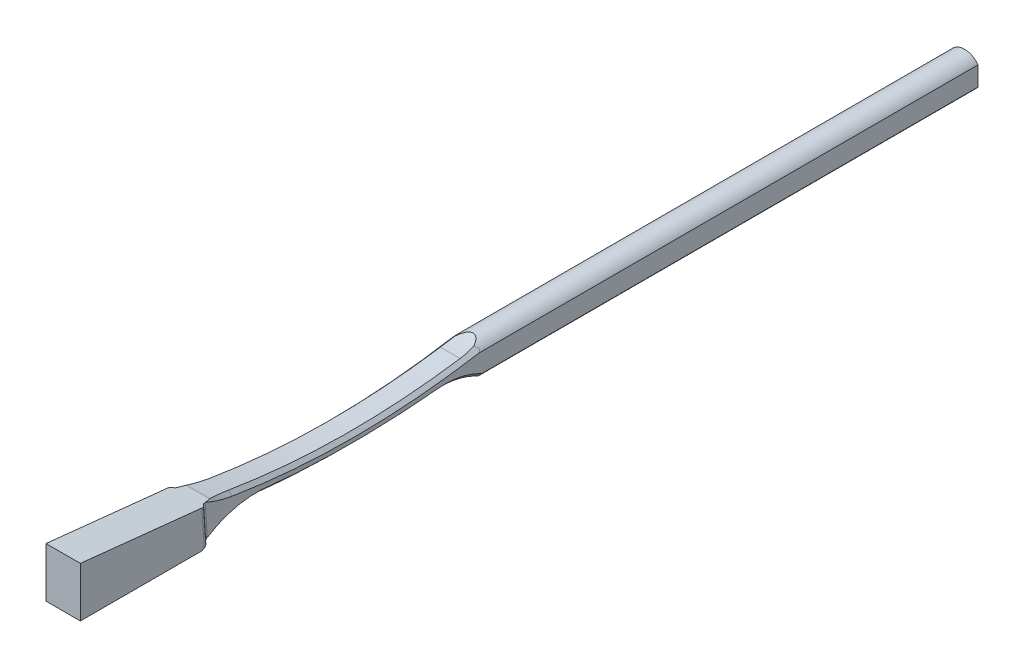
ISO-10303-21;
HEADER;
FILE_DESCRIPTION(('STEP AP214'),'2;1');
FILE_NAME('part.step','',(''),(''),'','','');
FILE_SCHEMA(('AUTOMOTIVE_DESIGN { 1 0 10303 214 1 1 1 1 }'));
ENDSEC;
DATA;
#1=APPLICATION_CONTEXT('core data for automotive mechanical design processes');
#2=APPLICATION_PROTOCOL_DEFINITION('international standard','automotive_design',2000,#1);
#3=PRODUCT_CONTEXT('',#1,'mechanical');
#4=PRODUCT('Part','Part','',(#3));
#5=PRODUCT_RELATED_PRODUCT_CATEGORY('part','',(#4));
#6=PRODUCT_DEFINITION_FORMATION('','',#4);
#7=PRODUCT_DEFINITION_CONTEXT('part definition',#1,'design');
#8=PRODUCT_DEFINITION('design','',#6,#7);
#9=PRODUCT_DEFINITION_SHAPE('','',#8);
#10=(LENGTH_UNIT() NAMED_UNIT(*) SI_UNIT(.MILLI.,.METRE.));
#11=(NAMED_UNIT(*) PLANE_ANGLE_UNIT() SI_UNIT($,.RADIAN.));
#12=(NAMED_UNIT(*) SI_UNIT($,.STERADIAN.) SOLID_ANGLE_UNIT());
#13=UNCERTAINTY_MEASURE_WITH_UNIT(LENGTH_MEASURE(1.E-05),#10,'distance_accuracy_value','');
#14=(GEOMETRIC_REPRESENTATION_CONTEXT(3) GLOBAL_UNCERTAINTY_ASSIGNED_CONTEXT((#13)) GLOBAL_UNIT_ASSIGNED_CONTEXT((#10,
#11,#12)) REPRESENTATION_CONTEXT('',''));
#15=CARTESIAN_POINT('',(0.,0.,0.));
#16=DIRECTION('',(0.,0.,1.));
#17=DIRECTION('',(1.,0.,0.));
#18=AXIS2_PLACEMENT_3D('',#15,#16,#17);
#19=CARTESIAN_POINT('',(2.413,-14.5808687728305,-31.6915845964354));
#20=DIRECTION('',(-1.,0.,0.));
#21=DIRECTION('',(0.,0.,1.));
#22=AXIS2_PLACEMENT_3D('',#19,#20,#21);
#23=CYLINDRICAL_SURFACE('',#22,17.5079566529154);
#24=CARTESIAN_POINT('',(-1.77799210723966,2.85884661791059,-33.2358880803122));
#25=CARTESIAN_POINT('',(-1.78775711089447,2.88075783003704,-32.9884417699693));
#26=CARTESIAN_POINT('',(-1.79805888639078,2.89739780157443,-32.7405821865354));
#27=CARTESIAN_POINT('',(-1.81971214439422,2.92011980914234,-32.2444276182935));
#28=CARTESIAN_POINT('',(-1.83106361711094,2.92620194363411,-31.9961326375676));
#29=CARTESIAN_POINT('',(-1.866655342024,2.92858875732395,-31.251211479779));
#30=CARTESIAN_POINT('',(-1.89243436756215,2.90903712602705,-30.7545119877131));
#31=CARTESIAN_POINT('',(-1.9471907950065,2.82877180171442,-29.7762957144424));
#32=CARTESIAN_POINT('',(-1.97608064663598,2.76901854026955,-29.2946931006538));
#33=CARTESIAN_POINT('',(-2.03726005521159,2.60981104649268,-28.3383972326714));
#34=CARTESIAN_POINT('',(-2.06954862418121,2.51036832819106,-27.8637020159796));
#35=CARTESIAN_POINT('',(-2.12637024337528,2.31073546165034,-27.0752517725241));
#36=CARTESIAN_POINT('',(-2.15006674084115,2.2210270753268,-26.7587372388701));
#37=CARTESIAN_POINT('',(-2.19880084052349,2.02396506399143,-26.1313582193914));
#38=CARTESIAN_POINT('',(-2.22383835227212,1.91661262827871,-25.8204933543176));
#39=CARTESIAN_POINT('',(-2.27556663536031,1.68275864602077,-25.2004769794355));
#40=CARTESIAN_POINT('',(-2.30227743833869,1.55597839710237,-24.8914323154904));
#41=CARTESIAN_POINT('',(-2.35688035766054,1.28498184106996,-24.2811239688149));
#42=CARTESIAN_POINT('',(-2.38477268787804,1.14076236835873,-23.9798617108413));
#43=CARTESIAN_POINT('',(-2.41319999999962,0.988054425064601,-23.6830156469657));
#44=B_SPLINE_CURVE_WITH_KNOTS('',3,(#24,#25,#26,#27,#28,#29,#30,#31,#32,#33,#34,#35,#36,#37,#38,
#39,#40,#41,#42,#43),.UNSPECIFIED.,.F.,.F.,(4,2,2,2,2,2,2,2,2,4),(0.,0.745698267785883,
1.49138958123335,2.9826607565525,4.43951352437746,5.89594396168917,6.8849693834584,
7.87392816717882,8.87869763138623,9.88364975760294),.UNSPECIFIED.);
#45=CARTESIAN_POINT('',(-1.77800000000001,2.85886432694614,-33.2356880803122));
#46=VERTEX_POINT('',#45);
#47=CARTESIAN_POINT('',(-2.413,0.989128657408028,-23.6851043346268));
#48=VERTEX_POINT('',#47);
#49=EDGE_CURVE('E580',#46,#48,#44,.T.);
#50=ORIENTED_EDGE('',*,*,#49,.F.);
#51=DIRECTION('',(-1.,0.,0.));
#52=VECTOR('',#51,1.);
#53=CARTESIAN_POINT('',(2.413,2.85886432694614,-33.2356880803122));
#54=LINE('',#53,#52);
#55=CARTESIAN_POINT('',(1.778,2.85886432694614,-33.2356880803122));
#56=VERTEX_POINT('',#55);
#57=EDGE_CURVE('E544',#56,#46,#54,.T.);
#58=ORIENTED_EDGE('',*,*,#57,.F.);
#59=CARTESIAN_POINT('',(1.77799210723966,2.85884661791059,-33.2358880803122));
#60=CARTESIAN_POINT('',(1.78775711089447,2.88075783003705,-32.9884417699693));
#61=CARTESIAN_POINT('',(1.79805888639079,2.89739780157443,-32.7405821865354));
#62=CARTESIAN_POINT('',(1.81971214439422,2.92011980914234,-32.2444276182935));
#63=CARTESIAN_POINT('',(1.83106361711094,2.92620194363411,-31.9961326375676));
#64=CARTESIAN_POINT('',(1.866655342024,2.92858875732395,-31.251211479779));
#65=CARTESIAN_POINT('',(1.89243436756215,2.90903712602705,-30.7545119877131));
#66=CARTESIAN_POINT('',(1.94719079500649,2.82877180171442,-29.7762957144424));
#67=CARTESIAN_POINT('',(1.97608064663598,2.76901854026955,-29.2946931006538));
#68=CARTESIAN_POINT('',(2.03726005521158,2.60981104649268,-28.3383972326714));
#69=CARTESIAN_POINT('',(2.0695486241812,2.51036832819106,-27.8637020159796));
#70=CARTESIAN_POINT('',(2.12637024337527,2.31073546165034,-27.0752517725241));
#71=CARTESIAN_POINT('',(2.15006674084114,2.22102707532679,-26.7587372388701));
#72=CARTESIAN_POINT('',(2.19880084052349,2.0239650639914,-26.1313582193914));
#73=CARTESIAN_POINT('',(2.22383835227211,1.91661262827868,-25.8204933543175));
#74=CARTESIAN_POINT('',(2.27556663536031,1.68275864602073,-25.2004769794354));
#75=CARTESIAN_POINT('',(2.30227743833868,1.55597839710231,-24.8914323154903));
#76=CARTESIAN_POINT('',(2.35688035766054,1.28498184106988,-24.2811239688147));
#77=CARTESIAN_POINT('',(2.38477268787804,1.14076236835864,-23.9798617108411));
#78=CARTESIAN_POINT('',(2.41319999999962,0.988054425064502,-23.6830156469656));
#79=B_SPLINE_CURVE_WITH_KNOTS('',3,(#59,#60,#61,#62,#63,#64,#65,#66,#67,#68,#69,#70,#71,#72,#73,
#74,#75,#76,#77,#78),.UNSPECIFIED.,.F.,.F.,(4,2,2,2,2,2,2,2,2,4),(0.,0.745698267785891,
1.49138958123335,2.9826607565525,4.43951352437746,5.89594396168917,6.88496938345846,
7.87392816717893,8.8786976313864,9.88364975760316),.UNSPECIFIED.);
#80=CARTESIAN_POINT('',(2.413,0.989128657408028,-23.6851043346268));
#81=VERTEX_POINT('',#80);
#82=EDGE_CURVE('E486',#56,#81,#79,.T.);
#83=ORIENTED_EDGE('',*,*,#82,.T.);
#84=CARTESIAN_POINT('',(2.413,-14.5808687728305,-31.6915845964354));
#85=DIRECTION('',(-1.,0.,0.));
#86=DIRECTION('',(0.,0.,-1.));
#87=AXIS2_PLACEMENT_3D('',#84,#85,#86);
#88=CIRCLE('',#87,17.5079566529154);
#89=CARTESIAN_POINT('',(2.413,0.921789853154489,-23.555484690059));
#90=VERTEX_POINT('',#89);
#91=EDGE_CURVE('E545',#90,#81,#88,.T.);
#92=ORIENTED_EDGE('',*,*,#91,.F.);
#93=CARTESIAN_POINT('',(3.09880000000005,1.28603841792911,-24.2909223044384));
#94=CARTESIAN_POINT('',(3.05785139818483,1.2841892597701,-24.2869661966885));
#95=CARTESIAN_POINT('',(3.01732909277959,1.28080816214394,-24.2797124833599));
#96=CARTESIAN_POINT('',(2.93833625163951,1.27117135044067,-24.2591199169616));
#97=CARTESIAN_POINT('',(2.89986028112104,1.26492372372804,-24.2457981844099));
#98=CARTESIAN_POINT('',(2.82593219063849,1.24973378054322,-24.2135584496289));
#99=CARTESIAN_POINT('',(2.7904788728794,1.24079253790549,-24.1946426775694));
#100=CARTESIAN_POINT('',(2.7234295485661,1.22047377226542,-24.1519108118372));
#101=CARTESIAN_POINT('',(2.69183505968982,1.20909529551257,-24.1280927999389));
#102=CARTESIAN_POINT('',(2.63221149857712,1.18378896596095,-24.0754839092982));
#103=CARTESIAN_POINT('',(2.60433629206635,1.16978880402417,-24.0465537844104));
#104=CARTESIAN_POINT('',(2.55395671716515,1.1398718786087,-23.9852220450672));
#105=CARTESIAN_POINT('',(2.53145400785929,1.12395452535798,-23.9528193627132));
#106=CARTESIAN_POINT('',(2.49078428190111,1.08941226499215,-23.8830986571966));
#107=CARTESIAN_POINT('',(2.47302967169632,1.07067591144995,-23.8455954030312));
#108=CARTESIAN_POINT('',(2.44427074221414,1.03190411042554,-23.7687237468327));
#109=CARTESIAN_POINT('',(2.43326847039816,1.01186827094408,-23.7293547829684));
#110=CARTESIAN_POINT('',(2.417541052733,0.969481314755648,-23.6468684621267));
#111=CARTESIAN_POINT('',(2.41332643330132,0.94706747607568,-23.603685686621));
#112=CARTESIAN_POINT('',(2.41270983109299,0.901852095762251,-23.5174624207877));
#113=CARTESIAN_POINT('',(2.41631032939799,0.879050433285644,-23.474421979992));
#114=CARTESIAN_POINT('',(2.4315600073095,0.832573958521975,-23.387557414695));
#115=CARTESIAN_POINT('',(2.44358295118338,0.80890904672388,-23.3437929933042));
#116=CARTESIAN_POINT('',(2.47585162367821,0.762528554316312,-23.258847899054));
#117=CARTESIAN_POINT('',(2.49609872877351,0.73981313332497,-23.2176676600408));
#118=CARTESIAN_POINT('',(2.54430488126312,0.696290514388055,-23.1394538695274));
#119=CARTESIAN_POINT('',(2.57220712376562,0.675470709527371,-23.10239249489));
#120=CARTESIAN_POINT('',(2.6352811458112,0.636428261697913,-23.0334098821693));
#121=CARTESIAN_POINT('',(2.67045083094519,0.618204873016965,-23.0014871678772));
#122=CARTESIAN_POINT('',(2.74440195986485,0.586508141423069,-22.9462907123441));
#123=CARTESIAN_POINT('',(2.78273055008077,0.572784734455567,-22.9225549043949));
#124=CARTESIAN_POINT('',(2.86385759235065,0.549158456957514,-22.8818525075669));
#125=CARTESIAN_POINT('',(2.90664631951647,0.539247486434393,-22.8648715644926));
#126=CARTESIAN_POINT('',(2.97486629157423,0.527403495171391,-22.8446233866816));
#127=CARTESIAN_POINT('',(2.99925389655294,0.523896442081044,-22.8386387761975));
#128=CARTESIAN_POINT('',(3.04863485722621,0.518247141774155,-22.8290075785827));
#129=CARTESIAN_POINT('',(3.07362808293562,0.516104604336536,-22.8253604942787));
#130=CARTESIAN_POINT('',(3.09880000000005,0.514674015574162,-22.8229243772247));
#131=B_SPLINE_CURVE_WITH_KNOTS('',3,(#93,#94,#95,#96,#97,#98,#99,#100,#101,#102,#103,#104,#105,
#106,#107,#108,#109,#110,#111,#112,#113,#114,#115,#116,#117,#118,#119,#120,#121,#122,#123,#124,
#125,#126,#127,#128,#129,#130),.UNSPECIFIED.,.F.,.F.,(4,2,2,2,2,2,2,2,2,2,2,2,2,2,2,2,2,2,4),
(0.,0.123331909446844,0.246317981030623,0.36925508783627,0.492240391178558,0.619323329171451,
0.746445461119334,0.882443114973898,1.01848198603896,1.16434225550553,1.31024883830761,
1.46307794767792,1.61593264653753,1.76768241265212,1.91938850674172,2.05998927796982,
2.20028965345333,2.27621806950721,2.3521303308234),.UNSPECIFIED.);
#132=CARTESIAN_POINT('',(2.7559,0.583074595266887,-22.9403922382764));
#133=VERTEX_POINT('',#132);
#134=EDGE_CURVE('E480',#90,#133,#131,.T.);
#135=ORIENTED_EDGE('',*,*,#134,.T.);
#136=CARTESIAN_POINT('',(1.65532529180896,0.,-22.0000000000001));
#137=CARTESIAN_POINT('',(1.63341624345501,0.0279402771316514,-22.0420184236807));
#138=CARTESIAN_POINT('',(1.61591237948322,0.0567149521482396,-22.0857200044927));
#139=CARTESIAN_POINT('',(1.58987291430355,0.115062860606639,-22.1752353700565));
#140=CARTESIAN_POINT('',(1.5813395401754,0.144636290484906,-22.2210496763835));
#141=CARTESIAN_POINT('',(1.57341124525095,0.203687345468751,-22.3134995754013));
#142=CARTESIAN_POINT('',(1.57401342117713,0.233164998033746,-22.3601349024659));
#143=CARTESIAN_POINT('',(1.58449041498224,0.291217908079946,-22.4529390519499));
#144=CARTESIAN_POINT('',(1.59436459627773,0.31979322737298,-22.4991079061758));
#145=CARTESIAN_POINT('',(1.62338093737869,0.375055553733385,-22.5892959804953));
#146=CARTESIAN_POINT('',(1.64247382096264,0.401751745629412,-22.6333252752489));
#147=CARTESIAN_POINT('',(1.68980880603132,0.452534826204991,-22.7178589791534));
#148=CARTESIAN_POINT('',(1.71804697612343,0.476622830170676,-22.7583648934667));
#149=CARTESIAN_POINT('',(1.78044807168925,0.519348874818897,-22.8307949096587));
#150=CARTESIAN_POINT('',(1.8139040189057,0.538276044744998,-22.8631557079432));
#151=CARTESIAN_POINT('',(1.8873661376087,0.57240162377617,-22.9218584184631));
#152=CARTESIAN_POINT('',(1.92736621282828,0.587603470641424,-22.9482058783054));
#153=CARTESIAN_POINT('',(2.00771075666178,0.6120638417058,-22.9907869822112));
#154=CARTESIAN_POINT('',(2.04747322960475,0.621808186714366,-23.0078408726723));
#155=CARTESIAN_POINT('',(2.12995498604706,0.637432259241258,-23.0352509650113));
#156=CARTESIAN_POINT('',(2.17267223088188,0.643314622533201,-23.0456117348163));
#157=CARTESIAN_POINT('',(2.2555873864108,0.650600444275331,-23.0584542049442));
#158=CARTESIAN_POINT('',(2.29565623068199,0.652365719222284,-23.0615722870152));
#159=CARTESIAN_POINT('',(2.37579981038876,0.65242628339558,-23.0616791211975));
#160=CARTESIAN_POINT('',(2.41587454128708,0.650722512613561,-23.0586695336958));
#161=CARTESIAN_POINT('',(2.4934437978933,0.644032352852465,-23.0468767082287));
#162=CARTESIAN_POINT('',(2.53097962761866,0.639161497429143,-23.0382966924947));
#163=CARTESIAN_POINT('',(2.60392561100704,0.626424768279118,-23.0159328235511));
#164=CARTESIAN_POINT('',(2.63933565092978,0.618558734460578,-23.0021486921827));
#165=CARTESIAN_POINT('',(2.70808530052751,0.599845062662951,-22.9694956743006));
#166=CARTESIAN_POINT('',(2.74134536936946,0.588924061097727,-22.9505019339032));
#167=CARTESIAN_POINT('',(2.80404219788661,0.564538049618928,-22.9083169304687));
#168=CARTESIAN_POINT('',(2.83347791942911,0.551072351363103,-22.885124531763));
#169=CARTESIAN_POINT('',(2.8900824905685,0.520870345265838,-22.8334255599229));
#170=CARTESIAN_POINT('',(2.91691524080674,0.503964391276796,-22.8046507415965));
#171=CARTESIAN_POINT('',(2.96521499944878,0.468099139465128,-22.7440513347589));
#172=CARTESIAN_POINT('',(2.98668004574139,0.449139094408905,-22.7122256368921));
#173=CARTESIAN_POINT('',(3.025976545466,0.407570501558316,-22.6429921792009));
#174=CARTESIAN_POINT('',(3.04320511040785,0.38478733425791,-22.6053472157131));
#175=CARTESIAN_POINT('',(3.07081119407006,0.3378259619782,-22.5284450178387));
#176=CARTESIAN_POINT('',(3.08118467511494,0.313646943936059,-22.4891868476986));
#177=CARTESIAN_POINT('',(3.0958119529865,0.26190212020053,-22.405932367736));
#178=CARTESIAN_POINT('',(3.09932752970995,0.234243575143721,-22.3618636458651));
#179=CARTESIAN_POINT('',(3.09814487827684,0.178588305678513,-22.2740650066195));
#180=CARTESIAN_POINT('',(3.09344847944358,0.150591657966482,-22.2303350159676));
#181=CARTESIAN_POINT('',(3.07815619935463,0.101883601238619,-22.1549808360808));
#182=CARTESIAN_POINT('',(3.06931344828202,0.0810883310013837,-22.1230453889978));
#183=CARTESIAN_POINT('',(3.04714039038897,0.0400551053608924,-22.0604606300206));
#184=CARTESIAN_POINT('',(3.03381555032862,0.0198165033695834,-22.0298098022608));
#185=CARTESIAN_POINT('',(3.01827470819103,0.,-22.0000000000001));
#186=B_SPLINE_CURVE_WITH_KNOTS('',3,(#136,#137,#138,#139,#140,#141,#142,#143,#144,#145,#146,
#147,#148,#149,#150,#151,#152,#153,#154,#155,#156,#157,#158,#159,#160,#161,#162,#163,#164,#165,
#166,#167,#168,#169,#170,#171,#172,#173,#174,#175,#176,#177,#178,#179,#180,#181,#182,#183,#184,
#185),.UNSPECIFIED.,.F.,.F.,(4,2,2,2,2,2,2,2,2,2,2,2,2,2,2,2,2,2,2,2,2,2,2,2,4),(0.,
0.164767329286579,0.329575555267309,0.494331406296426,0.659075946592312,0.822949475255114,
0.986752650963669,1.13664243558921,1.28639337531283,1.41871409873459,1.55094442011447,
1.67102723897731,1.79107752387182,1.90697705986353,2.02288279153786,2.14185437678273,
2.26085819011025,2.38879633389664,2.51678117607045,2.65796284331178,2.79922759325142,
2.95500565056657,3.11074901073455,3.22784509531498,3.34479887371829),.UNSPECIFIED.);
#187=CARTESIAN_POINT('',(3.09879999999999,0.212420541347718,-22.3274435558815));
#188=VERTEX_POINT('',#187);
#189=EDGE_CURVE('E437',#133,#188,#186,.T.);
#190=ORIENTED_EDGE('',*,*,#189,.T.);
#191=CARTESIAN_POINT('',(3.0988,-14.5808687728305,-31.6915845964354));
#192=DIRECTION('',(-1.,0.,0.));
#193=DIRECTION('',(0.,0.,-1.));
#194=AXIS2_PLACEMENT_3D('',#191,#192,#193);
#195=CIRCLE('',#194,17.5079566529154);
#196=CARTESIAN_POINT('',(3.0988,0.,-22.0000000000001));
#197=VERTEX_POINT('',#196);
#198=EDGE_CURVE('E703',#197,#188,#195,.T.);
#199=ORIENTED_EDGE('',*,*,#198,.F.);
#200=DIRECTION('',(-1.,0.,0.));
#201=VECTOR('',#200,1.);
#202=CARTESIAN_POINT('',(2.413,0.,-22.0000000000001));
#203=LINE('',#202,#201);
#204=CARTESIAN_POINT('',(-3.0988,0.,-22.0000000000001));
#205=VERTEX_POINT('',#204);
#206=EDGE_CURVE('E547',#197,#205,#203,.T.);
#207=ORIENTED_EDGE('',*,*,#206,.T.);
#208=CARTESIAN_POINT('',(-3.0988,-14.5808687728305,-31.6915845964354));
#209=DIRECTION('',(-1.,0.,0.));
#210=DIRECTION('',(0.,0.,-1.));
#211=AXIS2_PLACEMENT_3D('',#208,#209,#210);
#212=CIRCLE('',#211,17.5079566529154);
#213=CARTESIAN_POINT('',(-3.0988,0.212420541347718,-22.3274435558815));
#214=VERTEX_POINT('',#213);
#215=EDGE_CURVE('E709',#205,#214,#212,.T.);
#216=ORIENTED_EDGE('',*,*,#215,.T.);
#217=CARTESIAN_POINT('',(-3.0988,0.212420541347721,-22.3274435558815));
#218=CARTESIAN_POINT('',(-3.09881790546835,0.240824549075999,-22.3722973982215));
#219=CARTESIAN_POINT('',(-3.09451372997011,0.26903573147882,-22.4173341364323));
#220=CARTESIAN_POINT('',(-3.07717426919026,0.324469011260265,-22.5066980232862));
#221=CARTESIAN_POINT('',(-3.06408685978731,0.351684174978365,-22.5510193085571));
#222=CARTESIAN_POINT('',(-3.02904228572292,0.404238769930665,-22.6374315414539));
#223=CARTESIAN_POINT('',(-3.00705971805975,0.429572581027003,-22.6795157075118));
#224=CARTESIAN_POINT('',(-2.95449574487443,0.477336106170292,-22.7595542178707));
#225=CARTESIAN_POINT('',(-2.9239517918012,0.499777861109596,-22.7975255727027));
#226=CARTESIAN_POINT('',(-2.86967980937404,0.532119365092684,-22.8526546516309));
#227=CARTESIAN_POINT('',(-2.84863597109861,0.543273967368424,-22.8717610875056));
#228=CARTESIAN_POINT('',(-2.80407453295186,0.564234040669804,-22.9078017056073));
#229=CARTESIAN_POINT('',(-2.78055193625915,0.574036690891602,-22.9247313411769));
#230=CARTESIAN_POINT('',(-2.7559,0.583074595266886,-22.9403922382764));
#231=B_SPLINE_CURVE_WITH_KNOTS('',3,(#217,#218,#219,#220,#221,#222,#223,#224,#225,#226,#227,
#228,#229,#230),.UNSPECIFIED.,.F.,.F.,(4,2,2,2,2,2,4),(0.,0.159182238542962,0.319317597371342,
0.479913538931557,0.639817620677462,0.731231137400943,0.822832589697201),.UNSPECIFIED.);
#232=CARTESIAN_POINT('',(-2.7559,0.583074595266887,-22.9403922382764));
#233=VERTEX_POINT('',#232);
#234=EDGE_CURVE('E461',#214,#233,#231,.T.);
#235=ORIENTED_EDGE('',*,*,#234,.T.);
#236=CARTESIAN_POINT('',(-3.09879999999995,0.514674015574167,-22.8229243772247));
#237=CARTESIAN_POINT('',(-3.07864845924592,0.51582051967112,-22.8248762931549));
#238=CARTESIAN_POINT('',(-3.05860931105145,0.517421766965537,-22.8276022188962));
#239=CARTESIAN_POINT('',(-3.01889404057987,0.521505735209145,-22.8345620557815));
#240=CARTESIAN_POINT('',(-2.99921777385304,0.523988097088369,-22.838795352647));
#241=CARTESIAN_POINT('',(-2.94110890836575,0.532687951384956,-22.8536503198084));
#242=CARTESIAN_POINT('',(-2.90339368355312,0.540170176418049,-22.8664472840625));
#243=CARTESIAN_POINT('',(-2.83102489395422,0.558115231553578,-22.8972668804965));
#244=CARTESIAN_POINT('',(-2.79636770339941,0.568574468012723,-22.9152832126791));
#245=CARTESIAN_POINT('',(-2.73076079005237,0.592024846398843,-22.955888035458));
#246=CARTESIAN_POINT('',(-2.69981435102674,0.60501820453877,-22.9784805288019));
#247=CARTESIAN_POINT('',(-2.64053551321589,0.633859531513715,-23.0289360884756));
#248=CARTESIAN_POINT('',(-2.61245847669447,0.649829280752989,-23.057028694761));
#249=CARTESIAN_POINT('',(-2.5615321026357,0.683498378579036,-23.1166901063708));
#250=CARTESIAN_POINT('',(-2.53868440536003,0.701198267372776,-23.1482599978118));
#251=CARTESIAN_POINT('',(-2.49648395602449,0.739664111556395,-23.2174159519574));
#252=CARTESIAN_POINT('',(-2.47771630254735,0.760559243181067,-23.2552876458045));
#253=CARTESIAN_POINT('',(-2.44714221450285,0.803199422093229,-23.3332970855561));
#254=CARTESIAN_POINT('',(-2.43533847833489,0.824944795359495,-23.3734357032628));
#255=CARTESIAN_POINT('',(-2.41828849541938,0.870292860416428,-23.4579578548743));
#256=CARTESIAN_POINT('',(-2.41357622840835,0.89391645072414,-23.502438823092));
#257=CARTESIAN_POINT('',(-2.41252303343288,0.940819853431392,-23.5916913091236));
#258=CARTESIAN_POINT('',(-2.41618366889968,0.964099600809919,-23.6364628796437));
#259=CARTESIAN_POINT('',(-2.43204287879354,1.00999904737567,-23.7256611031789));
#260=CARTESIAN_POINT('',(-2.44436205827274,1.03260466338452,-23.7700738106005));
#261=CARTESIAN_POINT('',(-2.47757275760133,1.07613609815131,-23.8564659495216));
#262=CARTESIAN_POINT('',(-2.49846279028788,1.09706220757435,-23.8984458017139));
#263=CARTESIAN_POINT('',(-2.54735032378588,1.13568359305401,-23.9766415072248));
#264=CARTESIAN_POINT('',(-2.57498732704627,1.15348163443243,-24.0130313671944));
#265=CARTESIAN_POINT('',(-2.63719142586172,1.18636487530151,-24.0807824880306));
#266=CARTESIAN_POINT('',(-2.67175559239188,1.20145121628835,-24.1121458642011));
#267=CARTESIAN_POINT('',(-2.74400371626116,1.22735043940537,-24.1663213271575));
#268=CARTESIAN_POINT('',(-2.78125183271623,1.23840075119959,-24.1896017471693));
#269=CARTESIAN_POINT('',(-2.85979218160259,1.25734832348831,-24.2296867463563));
#270=CARTESIAN_POINT('',(-2.90107886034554,1.26524984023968,-24.2465000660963));
#271=CARTESIAN_POINT('',(-2.96882106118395,1.27508324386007,-24.267474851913));
#272=CARTESIAN_POINT('',(-2.99441088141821,1.278134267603,-24.2739968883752));
#273=CARTESIAN_POINT('',(-3.04620829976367,1.2830109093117,-24.2844329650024));
#274=CARTESIAN_POINT('',(-3.07241536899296,1.28483753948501,-24.2883491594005));
#275=CARTESIAN_POINT('',(-3.09879999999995,1.28603841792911,-24.2909223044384));
#276=B_SPLINE_CURVE_WITH_KNOTS('',3,(#236,#237,#238,#239,#240,#241,#242,#243,#244,#245,#246,
#247,#248,#249,#250,#251,#252,#253,#254,#255,#256,#257,#258,#259,#260,#261,#262,#263,#264,#265,
#266,#267,#268,#269,#270,#271,#272,#273,#274,#275),.UNSPECIFIED.,.F.,.F.,(4,2,2,2,2,2,2,2,2,2,2,
2,2,2,2,2,2,2,2,4),(0.,0.0607930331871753,0.121561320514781,0.242494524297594,0.363282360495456,
0.484176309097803,0.61207516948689,0.740014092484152,0.880859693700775,1.02175983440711,
1.17281587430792,1.32390012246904,1.47713163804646,1.63033657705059,1.77667527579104,
1.92295222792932,2.05812796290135,2.19312035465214,2.27272200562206,2.35225776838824),.UNSPECIFIED.);
#277=CARTESIAN_POINT('',(-2.413,0.921789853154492,-23.555484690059));
#278=VERTEX_POINT('',#277);
#279=EDGE_CURVE('E472',#233,#278,#276,.T.);
#280=ORIENTED_EDGE('',*,*,#279,.T.);
#281=CARTESIAN_POINT('',(-2.413,-14.5808687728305,-31.6915845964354));
#282=DIRECTION('',(-1.,0.,0.));
#283=DIRECTION('',(0.,0.,-1.));
#284=AXIS2_PLACEMENT_3D('',#281,#282,#283);
#285=CIRCLE('',#284,17.5079566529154);
#286=EDGE_CURVE('E612',#278,#48,#285,.T.);
#287=ORIENTED_EDGE('',*,*,#286,.T.);
#288=EDGE_LOOP('',(#50,#58,#83,#92,#135,#190,#199,#207,#216,#235,#280,#287));
#289=FACE_BOUND('',#288,.T.);
#290=ADVANCED_FACE('F110',(#289),#23,.F.);
#291=CARTESIAN_POINT('',(2.413,-10.7833130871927,-66.374150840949));
#292=DIRECTION('',(1.,0.,0.));
#293=DIRECTION('',(0.,0.,-1.));
#294=AXIS2_PLACEMENT_3D('',#291,#292,#293);
#295=PLANE('',#294);
#296=DIRECTION('',(0.,0.,-1.));
#297=VECTOR('',#296,1.);
#298=CARTESIAN_POINT('',(2.413,5.23156894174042,-62.5000000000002));
#299=LINE('',#298,#297);
#300=CARTESIAN_POINT('',(2.413,5.23156894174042,-72.5449918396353));
#301=VERTEX_POINT('',#300);
#302=CARTESIAN_POINT('',(2.413,5.23156894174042,-162.5));
#303=VERTEX_POINT('',#302);
#304=EDGE_CURVE('E750',#301,#303,#299,.T.);
#305=ORIENTED_EDGE('',*,*,#304,.F.);
#306=CARTESIAN_POINT('',(2.41299999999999,138.431285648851,-49.9860819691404));
#307=DIRECTION('',(1.,0.,0.));
#308=DIRECTION('',(0.,0.,-1.));
#309=AXIS2_PLACEMENT_3D('',#306,#307,#308);
#310=CIRCLE('',#309,135.096517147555);
#311=CARTESIAN_POINT('',(2.41299999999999,5.14020332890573,-27.9734419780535));
#312=VERTEX_POINT('',#311);
#313=EDGE_CURVE('E376',#312,#301,#310,.T.);
#314=ORIENTED_EDGE('',*,*,#313,.F.);
#315=CARTESIAN_POINT('',(2.413,7.93876526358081,-20.2349617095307));
#316=CARTESIAN_POINT('',(2.413,7.605647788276,-20.9164914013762));
#317=CARTESIAN_POINT('',(2.413,6.93941283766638,-22.2795507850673));
#318=CARTESIAN_POINT('',(2.41299999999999,6.30987448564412,-23.762390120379));
#319=CARTESIAN_POINT('',(2.41299999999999,5.84471593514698,-25.0653162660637));
#320=CARTESIAN_POINT('',(2.41299999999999,5.4840337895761,-26.2347643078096));
#321=CARTESIAN_POINT('',(2.41299999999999,5.24089140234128,-27.3670986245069));
#322=CARTESIAN_POINT('',(2.41299999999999,5.14020332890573,-27.9734419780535));
#323=B_SPLINE_CURVE_WITH_KNOTS('',3,(#315,#316,#317,#318,#319,#320,#321,#322),.UNSPECIFIED.,.F.,
.F.,(4,1,1,1,1,4),(0.,0.28,0.560000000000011,0.584980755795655,0.78,1.),.UNSPECIFIED.);
#324=CARTESIAN_POINT('',(2.41299999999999,6.56332895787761,-23.1833601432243));
#325=VERTEX_POINT('',#324);
#326=EDGE_CURVE('E593',#325,#312,#323,.T.);
#327=ORIENTED_EDGE('',*,*,#326,.F.);
#328=DIRECTION('',(0.,0.104528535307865,0.994521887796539));
#329=VECTOR('',#328,1.);
#330=CARTESIAN_POINT('',(2.413,8.99999999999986,0.));
#331=LINE('',#330,#329);
#332=CARTESIAN_POINT('',(2.41300000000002,6.56402145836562,-23.1767714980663));
#333=VERTEX_POINT('',#332);
#334=EDGE_CURVE('E550',#325,#333,#331,.T.);
#335=ORIENTED_EDGE('',*,*,#334,.T.);
#336=DIRECTION('',(0.,0.997754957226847,0.066970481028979));
#337=VECTOR('',#336,1.);
#338=CARTESIAN_POINT('',(2.41299999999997,-9.28015622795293,-24.2402512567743));
#339=LINE('',#338,#337);
#340=EDGE_CURVE('E446',#90,#333,#339,.T.);
#341=ORIENTED_EDGE('',*,*,#340,.F.);
#342=ORIENTED_EDGE('',*,*,#91,.T.);
#343=CARTESIAN_POINT('',(2.413,-12.9976512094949,-32.4582807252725));
#344=DIRECTION('',(1.,0.,0.));
#345=DIRECTION('',(0.,0.,-1.));
#346=AXIS2_PLACEMENT_3D('',#343,#344,#345);
#347=CIRCLE('',#346,16.5105613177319);
#348=CARTESIAN_POINT('',(2.413,3.4921894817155,-33.2851960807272));
#349=VERTEX_POINT('',#348);
#350=EDGE_CURVE('E519',#349,#81,#347,.T.);
#351=ORIENTED_EDGE('',*,*,#350,.F.);
#352=CARTESIAN_POINT('',(2.413,3.4921894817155,-33.2851960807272));
#353=CARTESIAN_POINT('',(2.413,2.86015040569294,-39.1674730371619));
#354=CARTESIAN_POINT('',(2.413,2.33917704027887,-49.7744342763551));
#355=CARTESIAN_POINT('',(2.413,2.90753638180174,-60.3434382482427));
#356=CARTESIAN_POINT('',(2.413,3.36794450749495,-64.9641043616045));
#357=B_SPLINE_CURVE_WITH_KNOTS('',3,(#352,#353,#354,#355,#356),.UNSPECIFIED.,.F.,.F.,(4,1,4),
(0.,0.55999999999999,1.),.UNSPECIFIED.);
#358=CARTESIAN_POINT('',(2.413,3.36794450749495,-64.9641043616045));
#359=VERTEX_POINT('',#358);
#360=EDGE_CURVE('E1033',#349,#359,#357,.T.);
#361=ORIENTED_EDGE('',*,*,#360,.T.);
#362=CARTESIAN_POINT('',(2.413,-10.7833130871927,-66.374150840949));
#363=DIRECTION('',(-1.,0.,0.));
#364=DIRECTION('',(0.,0.,1.));
#365=AXIS2_PLACEMENT_3D('',#362,#363,#364);
#366=CIRCLE('',#365,14.2213333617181);
#367=CARTESIAN_POINT('',(2.413,1.76843105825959,-73.0599598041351));
#368=VERTEX_POINT('',#367);
#369=EDGE_CURVE('E518',#359,#368,#366,.T.);
#370=ORIENTED_EDGE('',*,*,#369,.T.);
#371=DIRECTION('',(0.,0.,-1.));
#372=VECTOR('',#371,1.);
#373=CARTESIAN_POINT('',(2.413,1.7684310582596,-62.5000000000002));
#374=LINE('',#373,#372);
#375=CARTESIAN_POINT('',(2.413,1.7684310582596,-162.5));
#376=VERTEX_POINT('',#375);
#377=EDGE_CURVE('E698',#368,#376,#374,.T.);
#378=ORIENTED_EDGE('',*,*,#377,.T.);
#379=DIRECTION('',(0.,1.,0.));
#380=VECTOR('',#379,1.);
#381=CARTESIAN_POINT('',(2.413,0.528200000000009,-162.5));
#382=LINE('',#381,#380);
#383=EDGE_CURVE('E615',#376,#303,#382,.T.);
#384=ORIENTED_EDGE('',*,*,#383,.T.);
#385=EDGE_LOOP('',(#305,#314,#327,#335,#341,#342,#351,#361,#370,#378,#384));
#386=FACE_BOUND('',#385,.T.);
#387=ADVANCED_FACE('F355',(#386),#295,.T.);
#388=CARTESIAN_POINT('',(2.413,26.8320964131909,-66.5841577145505));
#389=DIRECTION('',(-1.,0.,0.));
#390=DIRECTION('',(0.,0.,1.));
#391=AXIS2_PLACEMENT_3D('',#388,#389,#390);
#392=CYLINDRICAL_SURFACE('',#391,21.6347687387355);
#393=CARTESIAN_POINT('',(-2.413,5.23156894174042,-67.8008874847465));
#394=CARTESIAN_POINT('',(-2.40694470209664,5.23999043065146,-67.950412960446));
#395=CARTESIAN_POINT('',(-2.39973207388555,5.24996422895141,-68.0998078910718));
#396=CARTESIAN_POINT('',(-2.38277146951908,5.27299757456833,-68.3982311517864));
#397=CARTESIAN_POINT('',(-2.37302321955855,5.2860574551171,-68.5472594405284));
#398=CARTESIAN_POINT('',(-2.3507345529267,5.31529124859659,-68.8453109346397));
#399=CARTESIAN_POINT('',(-2.33818487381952,5.33147546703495,-68.9943324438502));
#400=CARTESIAN_POINT('',(-2.31000158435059,5.36689750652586,-69.2917166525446));
#401=CARTESIAN_POINT('',(-2.29436807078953,5.38613523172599,-69.4400793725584));
#402=CARTESIAN_POINT('',(-2.25882313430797,5.42857989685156,-69.7428168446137));
#403=CARTESIAN_POINT('',(-2.2387473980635,5.45192918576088,-69.8971525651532));
#404=CARTESIAN_POINT('',(-2.19422309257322,5.50185035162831,-70.2046663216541));
#405=CARTESIAN_POINT('',(-2.1697747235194,5.52842208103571,-70.3578444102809));
#406=CARTESIAN_POINT('',(-2.11581549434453,5.58464447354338,-70.6625106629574));
#407=CARTESIAN_POINT('',(-2.08631199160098,5.61429063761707,-70.8140009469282));
#408=CARTESIAN_POINT('',(-2.02129314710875,5.6765344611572,-71.1150553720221));
#409=CARTESIAN_POINT('',(-1.98577902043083,5.70913152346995,-71.2646198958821));
#410=CARTESIAN_POINT('',(-1.90807225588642,5.77657050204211,-71.5591495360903));
#411=CARTESIAN_POINT('',(-1.86598081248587,5.81137429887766,-71.7041497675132));
#412=CARTESIAN_POINT('',(-1.77318656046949,5.88331002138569,-71.9909519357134));
#413=CARTESIAN_POINT('',(-1.72247730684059,5.92044367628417,-72.1327513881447));
#414=CARTESIAN_POINT('',(-1.61089391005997,5.99608320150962,-72.4103283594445));
#415=CARTESIAN_POINT('',(-1.55012000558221,6.0345728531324,-72.5461500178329));
#416=CARTESIAN_POINT('',(-1.41531251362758,6.11225237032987,-72.8107281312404));
#417=CARTESIAN_POINT('',(-1.34130315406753,6.15144084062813,-72.9394969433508));
#418=CARTESIAN_POINT('',(-1.19152745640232,6.22151600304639,-73.1627767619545));
#419=CARTESIAN_POINT('',(-1.11870264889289,6.25257934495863,-73.2591792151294));
#420=CARTESIAN_POINT('',(-0.958902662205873,6.31223477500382,-73.440357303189));
#421=CARTESIAN_POINT('',(-0.871975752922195,6.34083480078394,-73.5251708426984));
#422=CARTESIAN_POINT('',(-0.722384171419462,6.38135465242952,-73.643370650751));
#423=CARTESIAN_POINT('',(-0.665351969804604,6.39516000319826,-73.683191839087));
#424=CARTESIAN_POINT('',(-0.545696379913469,6.42007532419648,-73.7545154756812));
#425=CARTESIAN_POINT('',(-0.483078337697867,6.43118783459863,-73.7860257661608));
#426=CARTESIAN_POINT('',(-0.36266412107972,6.44830349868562,-73.8343141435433));
#427=CARTESIAN_POINT('',(-0.305551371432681,6.45482274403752,-73.8525922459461));
#428=CARTESIAN_POINT('',(-0.188876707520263,6.46456412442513,-73.87984557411));
#429=CARTESIAN_POINT('',(-0.129317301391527,6.46778955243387,-73.8888300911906));
#430=CARTESIAN_POINT('',(-0.00922114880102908,6.47059466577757,-73.8966460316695));
#431=CARTESIAN_POINT('',(0.0513183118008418,6.4701613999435,-73.895441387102));
#432=CARTESIAN_POINT('',(0.171207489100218,6.46566897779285,-73.8829173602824));
#433=CARTESIAN_POINT('',(0.230556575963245,6.4616079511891,-73.8715927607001));
#434=CARTESIAN_POINT('',(0.343739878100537,6.45056507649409,-73.8406477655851));
#435=CARTESIAN_POINT('',(0.397702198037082,6.44372638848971,-73.8214335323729));
#436=CARTESIAN_POINT('',(0.502246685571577,6.42770376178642,-73.7761364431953));
#437=CARTESIAN_POINT('',(0.552827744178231,6.41851905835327,-73.7500513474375));
#438=CARTESIAN_POINT('',(0.684415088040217,6.39130456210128,-73.6721695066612));
#439=CARTESIAN_POINT('',(0.761968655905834,6.37158030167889,-73.6151471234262));
#440=CARTESIAN_POINT('',(0.907008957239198,6.32913140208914,-73.4903878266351));
#441=CARTESIAN_POINT('',(0.974461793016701,6.30639712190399,-73.4226163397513));
#442=CARTESIAN_POINT('',(1.09471882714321,6.26155876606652,-73.2864608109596));
#443=CARTESIAN_POINT('',(1.14829970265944,6.23958901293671,-73.2187062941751));
#444=CARTESIAN_POINT('',(1.24924947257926,6.19505522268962,-73.0788587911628));
#445=CARTESIAN_POINT('',(1.29661289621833,6.1724906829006,-73.0067620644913));
#446=CARTESIAN_POINT('',(1.38605709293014,6.12721513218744,-72.8592731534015));
#447=CARTESIAN_POINT('',(1.42812940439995,6.10450394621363,-72.7838759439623));
#448=CARTESIAN_POINT('',(1.50767501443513,6.05927881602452,-72.6306159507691));
#449=CARTESIAN_POINT('',(1.54514647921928,6.03676495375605,-72.5527521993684));
#450=CARTESIAN_POINT('',(1.6201694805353,5.98960534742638,-72.386064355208));
#451=CARTESIAN_POINT('',(1.65723612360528,5.96501166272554,-72.2970083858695));
#452=CARTESIAN_POINT('',(1.72710396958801,5.91657026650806,-72.117030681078));
#453=CARTESIAN_POINT('',(1.75990412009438,5.8927227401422,-72.0261084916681));
#454=CARTESIAN_POINT('',(1.85282355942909,5.82250272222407,-71.7509734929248));
#455=CARTESIAN_POINT('',(1.9074009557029,5.77749282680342,-71.5645331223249));
#456=CARTESIAN_POINT('',(2.00529611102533,5.6917802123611,-71.187185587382));
#457=CARTESIAN_POINT('',(2.04857768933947,5.6510915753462,-70.9962661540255));
#458=CARTESIAN_POINT('',(2.12600947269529,5.57459440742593,-70.6115996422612));
#459=CARTESIAN_POINT('',(2.16015784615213,5.53878685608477,-70.4178520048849));
#460=CARTESIAN_POINT('',(2.22185400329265,5.47139687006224,-70.0229053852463));
#461=CARTESIAN_POINT('',(2.24919126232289,5.43996003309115,-69.8216492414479));
#462=CARTESIAN_POINT('',(2.29733678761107,5.38269384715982,-69.4175322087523));
#463=CARTESIAN_POINT('',(2.31814368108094,5.35686567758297,-69.2146709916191));
#464=CARTESIAN_POINT('',(2.35398061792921,5.31122024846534,-68.8103585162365));
#465=CARTESIAN_POINT('',(2.36907951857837,5.29133199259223,-68.608921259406));
#466=CARTESIAN_POINT('',(2.39447866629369,5.25720481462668,-68.2053617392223));
#467=CARTESIAN_POINT('',(2.40478119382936,5.2429632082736,-68.003239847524));
#468=CARTESIAN_POINT('',(2.41300000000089,5.23156894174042,-67.8008874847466));
#469=B_SPLINE_CURVE_WITH_KNOTS('',3,(#393,#394,#395,#396,#397,#398,#399,#400,#401,#402,#403,
#404,#405,#406,#407,#408,#409,#410,#411,#412,#413,#414,#415,#416,#417,#418,#419,#420,#421,#422,
#423,#424,#425,#426,#427,#428,#429,#430,#431,#432,#433,#434,#435,#436,#437,#438,#439,#440,#441,
#442,#443,#444,#445,#446,#447,#448,#449,#450,#451,#452,#453,#454,#455,#456,#457,#458,#459,#460,
#461,#462,#463,#464,#465,#466,#467,#468),.UNSPECIFIED.,.F.,.F.,(4,2,2,2,2,2,2,2,2,2,2,2,2,2,2,2,
2,2,2,2,2,2,2,2,2,2,2,2,2,2,2,2,2,2,2,2,2,4),(0.,0.449647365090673,0.899343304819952,
1.35054870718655,1.80173994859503,2.27378302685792,2.74580449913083,3.21714472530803,
3.68838978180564,4.15299231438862,4.61794385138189,5.07851614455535,5.53825381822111,
5.91163182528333,6.28375776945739,6.4959252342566,6.70789177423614,6.88809676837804,
7.06812142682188,7.24878360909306,7.42953898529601,7.60196813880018,7.77445357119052,
8.06753198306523,8.36157291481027,8.62857214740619,8.8958047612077,9.16345944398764,
9.43122046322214,9.72972822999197,10.0283094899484,10.6259462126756,11.2254743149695,
11.8251225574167,12.4414859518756,13.0579788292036,13.6667775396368,14.2752864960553),.UNSPECIFIED.);
#470=CARTESIAN_POINT('',(-1.64553703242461,5.972469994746,-72.3234263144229));
#471=VERTEX_POINT('',#470);
#472=CARTESIAN_POINT('',(1.64553703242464,5.97246999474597,-72.3234263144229));
#473=VERTEX_POINT('',#472);
#474=EDGE_CURVE('E361',#471,#473,#469,.T.);
#475=ORIENTED_EDGE('',*,*,#474,.F.);
#476=CARTESIAN_POINT('',(-1.5778,6.13972660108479,-72.8999355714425));
#477=CARTESIAN_POINT('',(-1.61463773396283,6.05329882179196,-72.6168158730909));
#478=CARTESIAN_POINT('',(-1.64647043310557,5.97252234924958,-72.3313130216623));
#479=CARTESIAN_POINT('',(-1.69991077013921,5.82279177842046,-71.757161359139));
#480=CARTESIAN_POINT('',(-1.72154746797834,5.75380444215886,-71.468523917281));
#481=CARTESIAN_POINT('',(-1.75459371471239,5.62767232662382,-70.888088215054));
#482=CARTESIAN_POINT('',(-1.76600318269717,5.5705276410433,-70.5962899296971));
#483=CARTESIAN_POINT('',(-1.77856140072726,5.46812830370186,-70.0095305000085));
#484=CARTESIAN_POINT('',(-1.77968054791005,5.42290831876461,-69.7145626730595));
#485=CARTESIAN_POINT('',(-1.77560484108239,5.38383928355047,-69.4188507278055));
#486=B_SPLINE_CURVE_WITH_KNOTS('',3,(#476,#477,#478,#479,#480,#481,#482,#483,#484,#485),
.UNSPECIFIED.,.F.,.F.,(4,2,2,2,4),(0.,0.894808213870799,1.78705044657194,2.67929973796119,
3.57411502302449),.UNSPECIFIED.);
#487=CARTESIAN_POINT('',(-1.77799999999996,5.43271475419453,-69.7668740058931));
#488=VERTEX_POINT('',#487);
#489=EDGE_CURVE('E344',#471,#488,#486,.T.);
#490=ORIENTED_EDGE('',*,*,#489,.T.);
#491=DIRECTION('',(-1.,0.,0.));
#492=VECTOR('',#491,1.);
#493=CARTESIAN_POINT('',(2.413,5.43271475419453,-69.7668740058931));
#494=LINE('',#493,#492);
#495=CARTESIAN_POINT('',(1.77799999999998,5.43271475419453,-69.7668740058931));
#496=VERTEX_POINT('',#495);
#497=EDGE_CURVE('E633',#496,#488,#494,.T.);
#498=ORIENTED_EDGE('',*,*,#497,.F.);
#499=CARTESIAN_POINT('',(1.5778,6.13972660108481,-72.8999355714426));
#500=CARTESIAN_POINT('',(1.61493925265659,6.05259166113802,-72.6145004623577));
#501=CARTESIAN_POINT('',(1.64699095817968,5.97120122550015,-72.3266428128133));
#502=CARTESIAN_POINT('',(1.70069978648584,5.82044099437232,-71.7477434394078));
#503=CARTESIAN_POINT('',(1.72238693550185,5.75103685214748,-71.4567134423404));
#504=CARTESIAN_POINT('',(1.7553653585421,5.62426883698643,-70.8714545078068));
#505=CARTESIAN_POINT('',(1.76665654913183,5.56690506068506,-70.577225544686));
#506=CARTESIAN_POINT('',(1.77880927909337,5.46426551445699,-69.9855668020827));
#507=CARTESIAN_POINT('',(1.77964023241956,5.41902557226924,-69.6881301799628));
#508=CARTESIAN_POINT('',(1.77519107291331,5.38003965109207,-69.3899515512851));
#509=B_SPLINE_CURVE_WITH_KNOTS('',3,(#499,#500,#501,#502,#503,#504,#505,#506,#507,#508),
.UNSPECIFIED.,.F.,.F.,(4,2,2,2,4),(0.,0.902124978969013,1.80162040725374,2.70112305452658,
3.60325526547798),.UNSPECIFIED.);
#510=EDGE_CURVE('E368',#473,#496,#509,.T.);
#511=ORIENTED_EDGE('',*,*,#510,.F.);
#512=EDGE_LOOP('',(#475,#490,#498,#511));
#513=FACE_BOUND('',#512,.T.);
#514=ADVANCED_FACE('F352',(#513),#392,.F.);
#515=CARTESIAN_POINT('',(2.413,138.431285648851,-49.9860819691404));
#516=DIRECTION('',(-1.,0.,0.));
#517=DIRECTION('',(0.,0.,1.));
#518=AXIS2_PLACEMENT_3D('',#515,#516,#517);
#519=CYLINDRICAL_SURFACE('',#518,134.461517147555);
#520=ORIENTED_EDGE('',*,*,#497,.T.);
#521=CARTESIAN_POINT('',(-1.778,138.431285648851,-49.9860819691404));
#522=DIRECTION('',(-1.,0.,0.));
#523=DIRECTION('',(0.,0.,1.));
#524=AXIS2_PLACEMENT_3D('',#521,#522,#523);
#525=CIRCLE('',#524,134.461517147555);
#526=CARTESIAN_POINT('',(-1.778,5.76671716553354,-28.0769089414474));
#527=VERTEX_POINT('',#526);
#528=EDGE_CURVE('E350',#488,#527,#525,.T.);
#529=ORIENTED_EDGE('',*,*,#528,.T.);
#530=CARTESIAN_POINT('',(-1.77799999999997,5.76671716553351,-28.0769089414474));
#531=CARTESIAN_POINT('',(-1.77799501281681,5.79891211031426,-27.8819604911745));
#532=CARTESIAN_POINT('',(-1.78074823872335,5.83153491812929,-27.687097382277));
#533=CARTESIAN_POINT('',(-1.79163084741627,5.89761261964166,-27.2976685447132));
#534=CARTESIAN_POINT('',(-1.79976005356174,5.93106748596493,-27.1031028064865));
#535=CARTESIAN_POINT('',(-1.83195419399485,6.03249879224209,-26.5208785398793));
#536=CARTESIAN_POINT('',(-1.8638269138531,6.10168394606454,-26.1338332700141));
#537=CARTESIAN_POINT('',(-1.93158201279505,6.21678140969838,-25.5057790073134));
#538=CARTESIAN_POINT('',(-1.96157479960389,6.26178998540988,-25.2639405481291));
#539=CARTESIAN_POINT('',(-2.01208330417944,6.33018385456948,-24.9019514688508));
#540=CARTESIAN_POINT('',(-2.02985329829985,6.35314452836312,-24.7813349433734));
#541=CARTESIAN_POINT('',(-2.06713131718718,6.39934594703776,-24.5404234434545));
#542=CARTESIAN_POINT('',(-2.08663935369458,6.42258669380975,-24.4201284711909));
#543=CARTESIAN_POINT('',(-2.10696673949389,6.44596530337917,-24.3));
#544=B_SPLINE_CURVE_WITH_KNOTS('',3,(#530,#531,#532,#533,#534,#535,#536,#537,#538,#539,#540,
#541,#542,#543),.UNSPECIFIED.,.F.,.F.,(4,2,2,2,2,2,4),(0.,0.59272038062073,1.18542128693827,
2.36821251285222,3.11154648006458,3.48371899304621,3.85589402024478),.UNSPECIFIED.);
#545=CARTESIAN_POINT('',(-2.10696673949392,6.44596530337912,-24.3));
#546=VERTEX_POINT('',#545);
#547=EDGE_CURVE('E287',#527,#546,#544,.T.);
#548=ORIENTED_EDGE('',*,*,#547,.T.);
#549=DIRECTION('',(-1.,0.,0.));
#550=VECTOR('',#549,1.);
#551=CARTESIAN_POINT('',(2.413,6.44596530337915,-24.2999999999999));
#552=LINE('',#551,#550);
#553=CARTESIAN_POINT('',(2.10696673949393,6.44596530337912,-24.3));
#554=VERTEX_POINT('',#553);
#555=EDGE_CURVE('E630',#554,#546,#552,.T.);
#556=ORIENTED_EDGE('',*,*,#555,.F.);
#557=CARTESIAN_POINT('',(2.10696673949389,6.44596530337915,-24.3));
#558=CARTESIAN_POINT('',(2.09079856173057,6.42735712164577,-24.3956161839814));
#559=CARTESIAN_POINT('',(2.07513722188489,6.40883660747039,-24.4913361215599));
#560=CARTESIAN_POINT('',(2.04489720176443,6.37197291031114,-24.6829787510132));
#561=CARTESIAN_POINT('',(2.03031849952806,6.35362972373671,-24.7789014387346));
#562=CARTESIAN_POINT('',(1.98830638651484,6.2988647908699,-25.0669893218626));
#563=CARTESIAN_POINT('',(1.96259985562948,6.26271096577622,-25.2594574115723));
#564=CARTESIAN_POINT('',(1.89276811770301,6.15551847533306,-25.8370839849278));
#565=CARTESIAN_POINT('',(1.85577891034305,6.08557670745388,-26.2233486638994));
#566=CARTESIAN_POINT('',(1.81222571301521,5.97421081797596,-26.8541960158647));
#567=CARTESIAN_POINT('',(1.79946566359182,5.93182986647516,-27.0981994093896));
#568=CARTESIAN_POINT('',(1.78234225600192,5.84831166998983,-27.5870590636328));
#569=CARTESIAN_POINT('',(1.77799052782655,5.80717622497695,-27.8319160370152));
#570=CARTESIAN_POINT('',(1.778,5.76671716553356,-28.0769089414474));
#571=B_SPLINE_CURVE_WITH_KNOTS('',3,(#557,#558,#559,#560,#561,#562,#563,#564,#565,#566,#567,
#568,#569,#570),.UNSPECIFIED.,.F.,.F.,(4,2,2,2,2,2,4),(0.,0.296228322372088,0.592450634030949,
1.18494769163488,2.36720501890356,3.11102893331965,3.85588093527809),.UNSPECIFIED.);
#572=CARTESIAN_POINT('',(1.778,5.76671716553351,-28.0769089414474));
#573=VERTEX_POINT('',#572);
#574=EDGE_CURVE('E1032',#554,#573,#571,.T.);
#575=ORIENTED_EDGE('',*,*,#574,.T.);
#576=CARTESIAN_POINT('',(1.778,138.431285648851,-49.9860819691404));
#577=DIRECTION('',(1.,0.,0.));
#578=DIRECTION('',(0.,0.,-1.));
#579=AXIS2_PLACEMENT_3D('',#576,#577,#578);
#580=CIRCLE('',#579,134.461517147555);
#581=EDGE_CURVE('E375',#496,#573,#580,.F.);
#582=ORIENTED_EDGE('',*,*,#581,.F.);
#583=EDGE_LOOP('',(#520,#529,#548,#556,#575,#582));
#584=FACE_BOUND('',#583,.T.);
#585=ADVANCED_FACE('F321',(#584),#519,.F.);
#586=CARTESIAN_POINT('',(0.,3.50000000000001,-62.5000000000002));
#587=DIRECTION('',(0.,0.,-1.));
#588=DIRECTION('',(-1.,0.,0.));
#589=AXIS2_PLACEMENT_3D('',#586,#587,#588);
#590=CYLINDRICAL_SURFACE('',#589,2.97);
#591=CARTESIAN_POINT('',(-1.49430000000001,6.06670362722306,-71.9702590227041));
#592=CARTESIAN_POINT('',(-1.51566223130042,6.05424719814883,-72.0256449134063));
#593=CARTESIAN_POINT('',(-1.53769828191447,6.04107919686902,-72.080664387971));
#594=CARTESIAN_POINT('',(-1.58378100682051,6.01262910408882,-72.1898968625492));
#595=CARTESIAN_POINT('',(-1.60784377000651,5.99732931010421,-72.2440983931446));
#596=CARTESIAN_POINT('',(-1.65953061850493,5.96330235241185,-72.3532592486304));
#597=CARTESIAN_POINT('',(-1.68727210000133,5.94444290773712,-72.4081230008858));
#598=CARTESIAN_POINT('',(-1.74610848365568,5.90277254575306,-72.514282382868));
#599=CARTESIAN_POINT('',(-1.77718906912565,5.87997826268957,-72.5655918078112));
#600=CARTESIAN_POINT('',(-1.82979557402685,5.83951336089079,-72.6411881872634));
#601=CARTESIAN_POINT('',(-1.8497110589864,5.82383073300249,-72.6676353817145));
#602=CARTESIAN_POINT('',(-1.89135502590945,5.79006399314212,-72.7171839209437));
#603=CARTESIAN_POINT('',(-1.91307245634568,5.77199416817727,-72.7403035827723));
#604=CARTESIAN_POINT('',(-1.95175650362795,5.7387463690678,-72.7752696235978));
#605=CARTESIAN_POINT('',(-1.96818849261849,5.72433221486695,-72.7884155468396));
#606=CARTESIAN_POINT('',(-2.00200922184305,5.69394008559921,-72.8112475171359));
#607=CARTESIAN_POINT('',(-2.01939644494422,5.67796456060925,-72.8209388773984));
#608=CARTESIAN_POINT('',(-2.05151227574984,5.64769406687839,-72.8344073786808));
#609=CARTESIAN_POINT('',(-2.06613812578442,5.63363442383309,-72.8389466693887));
#610=CARTESIAN_POINT('',(-2.09542932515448,5.60487431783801,-72.8445347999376));
#611=CARTESIAN_POINT('',(-2.11009463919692,5.59017431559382,-72.8455861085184));
#612=CARTESIAN_POINT('',(-2.13902240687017,5.56056108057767,-72.8440725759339));
#613=CARTESIAN_POINT('',(-2.1532847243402,5.54564777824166,-72.8415065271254));
#614=CARTESIAN_POINT('',(-2.1810267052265,5.51604453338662,-72.8330492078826));
#615=CARTESIAN_POINT('',(-2.19450569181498,5.50135479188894,-72.8271551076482));
#616=CARTESIAN_POINT('',(-2.22558695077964,5.46682360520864,-72.8097183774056));
#617=CARTESIAN_POINT('',(-2.24272278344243,5.44723137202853,-72.7968654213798));
#618=CARTESIAN_POINT('',(-2.27503341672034,5.40938358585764,-72.767308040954));
#619=CARTESIAN_POINT('',(-2.29020247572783,5.39113201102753,-72.7505927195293));
#620=CARTESIAN_POINT('',(-2.33069166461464,5.34133402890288,-72.6995752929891));
#621=CARTESIAN_POINT('',(-2.35397866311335,5.31133609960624,-72.6621971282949));
#622=CARTESIAN_POINT('',(-2.39645018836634,5.25475779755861,-72.5828065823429));
#623=CARTESIAN_POINT('',(-2.41561754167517,5.22819190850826,-72.5407758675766));
#624=CARTESIAN_POINT('',(-2.44508469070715,5.18608436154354,-72.4684384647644));
#625=CARTESIAN_POINT('',(-2.45621391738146,5.16981410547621,-72.4388801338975));
#626=CARTESIAN_POINT('',(-2.47726577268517,5.13841476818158,-72.3791352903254));
#627=CARTESIAN_POINT('',(-2.48719888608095,5.12327629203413,-72.348957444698));
#628=CARTESIAN_POINT('',(-2.49669999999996,5.10853632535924,-72.3184714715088));
#629=B_SPLINE_CURVE_WITH_KNOTS('',3,(#591,#592,#593,#594,#595,#596,#597,#598,#599,#600,#601,
#602,#603,#604,#605,#606,#607,#608,#609,#610,#611,#612,#613,#614,#615,#616,#617,#618,#619,#620,
#621,#622,#623,#624,#625,#626,#627,#628),.UNSPECIFIED.,.F.,.F.,(4,2,2,2,2,2,2,2,2,2,2,2,2,2,2,2,
2,2,4),(0.,0.182033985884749,0.365681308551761,0.558430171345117,0.750383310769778,
0.860108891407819,0.969205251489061,1.04550294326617,1.12168277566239,1.18377895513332,
1.24583117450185,1.30790411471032,1.3700299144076,1.45661979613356,1.54345702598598,
1.702418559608,1.86203042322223,1.96857293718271,2.07410045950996),.UNSPECIFIED.);
#630=CARTESIAN_POINT('',(-2.41299999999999,5.23156894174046,-72.5449918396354));
#631=VERTEX_POINT('',#630);
#632=EDGE_CURVE('E295',#471,#631,#629,.T.);
#633=ORIENTED_EDGE('',*,*,#632,.F.);
#634=ORIENTED_EDGE('',*,*,#474,.T.);
#635=CARTESIAN_POINT('',(1.49429999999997,6.06670362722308,-71.970259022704));
#636=CARTESIAN_POINT('',(1.51566223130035,6.05424719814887,-72.0256449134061));
#637=CARTESIAN_POINT('',(1.53769828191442,6.04107919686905,-72.0806643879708));
#638=CARTESIAN_POINT('',(1.58378100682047,6.01262910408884,-72.189896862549));
#639=CARTESIAN_POINT('',(1.60784377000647,5.99732931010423,-72.2440983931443));
#640=CARTESIAN_POINT('',(1.65953061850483,5.96330235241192,-72.3532592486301));
#641=CARTESIAN_POINT('',(1.68727210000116,5.94444290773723,-72.4081230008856));
#642=CARTESIAN_POINT('',(1.74610848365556,5.90277254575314,-72.5142823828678));
#643=CARTESIAN_POINT('',(1.77718906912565,5.87997826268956,-72.5655918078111));
#644=CARTESIAN_POINT('',(1.82979557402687,5.83951336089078,-72.6411881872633));
#645=CARTESIAN_POINT('',(1.84971105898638,5.8238307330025,-72.6676353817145));
#646=CARTESIAN_POINT('',(1.89135502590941,5.79006399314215,-72.7171839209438));
#647=CARTESIAN_POINT('',(1.91307245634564,5.7719941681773,-72.7403035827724));
#648=CARTESIAN_POINT('',(1.95175650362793,5.73874636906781,-72.7752696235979));
#649=CARTESIAN_POINT('',(1.96818849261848,5.72433221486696,-72.7884155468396));
#650=CARTESIAN_POINT('',(2.00200922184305,5.69394008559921,-72.8112475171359));
#651=CARTESIAN_POINT('',(2.01939644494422,5.67796456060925,-72.8209388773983));
#652=CARTESIAN_POINT('',(2.05151227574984,5.64769406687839,-72.8344073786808));
#653=CARTESIAN_POINT('',(2.06613812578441,5.6336344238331,-72.8389466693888));
#654=CARTESIAN_POINT('',(2.09542932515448,5.60487431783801,-72.8445347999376));
#655=CARTESIAN_POINT('',(2.11009463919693,5.59017431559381,-72.8455861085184));
#656=CARTESIAN_POINT('',(2.13902240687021,5.56056108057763,-72.8440725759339));
#657=CARTESIAN_POINT('',(2.15328472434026,5.5456477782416,-72.8415065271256));
#658=CARTESIAN_POINT('',(2.18102670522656,5.51604453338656,-72.8330492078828));
#659=CARTESIAN_POINT('',(2.19450569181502,5.5013547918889,-72.8271551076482));
#660=CARTESIAN_POINT('',(2.22558695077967,5.46682360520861,-72.8097183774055));
#661=CARTESIAN_POINT('',(2.24272278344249,5.44723137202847,-72.7968654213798));
#662=CARTESIAN_POINT('',(2.27503341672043,5.40938358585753,-72.7673080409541));
#663=CARTESIAN_POINT('',(2.29020247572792,5.39113201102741,-72.7505927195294));
#664=CARTESIAN_POINT('',(2.33069166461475,5.34133402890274,-72.6995752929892));
#665=CARTESIAN_POINT('',(2.35397866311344,5.31133609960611,-72.6621971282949));
#666=CARTESIAN_POINT('',(2.39645018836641,5.2547577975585,-72.5828065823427));
#667=CARTESIAN_POINT('',(2.41561754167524,5.22819190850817,-72.5407758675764));
#668=CARTESIAN_POINT('',(2.44508469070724,5.18608436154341,-72.4684384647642));
#669=CARTESIAN_POINT('',(2.45621391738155,5.16981410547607,-72.4388801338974));
#670=CARTESIAN_POINT('',(2.47726577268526,5.13841476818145,-72.3791352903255));
#671=CARTESIAN_POINT('',(2.48719888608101,5.12327629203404,-72.3489574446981));
#672=CARTESIAN_POINT('',(2.49669999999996,5.10853632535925,-72.318471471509));
#673=B_SPLINE_CURVE_WITH_KNOTS('',3,(#635,#636,#637,#638,#639,#640,#641,#642,#643,#644,#645,
#646,#647,#648,#649,#650,#651,#652,#653,#654,#655,#656,#657,#658,#659,#660,#661,#662,#663,#664,
#665,#666,#667,#668,#669,#670,#671,#672),.UNSPECIFIED.,.F.,.F.,(4,2,2,2,2,2,2,2,2,2,2,2,2,2,2,2,
2,2,4),(0.,0.182033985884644,0.365681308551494,0.55843017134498,0.750383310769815,
0.860108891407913,0.969205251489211,1.04550294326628,1.12168277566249,1.18377895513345,
1.24583117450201,1.3079041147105,1.37002991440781,1.45661979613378,1.54345702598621,
1.70241855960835,1.86203042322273,1.968572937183,2.07410045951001),.UNSPECIFIED.);
#674=EDGE_CURVE('E398',#473,#301,#673,.T.);
#675=ORIENTED_EDGE('',*,*,#674,.T.);
#676=ORIENTED_EDGE('',*,*,#304,.T.);
#677=CARTESIAN_POINT('',(0.,3.50000000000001,-162.5));
#678=DIRECTION('',(0.,0.,-1.));
#679=DIRECTION('',(-1.,0.,0.));
#680=AXIS2_PLACEMENT_3D('',#677,#678,#679);
#681=CIRCLE('',#680,2.97);
#682=CARTESIAN_POINT('',(-2.413,5.23156894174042,-162.5));
#683=VERTEX_POINT('',#682);
#684=EDGE_CURVE('E755',#683,#303,#681,.T.);
#685=ORIENTED_EDGE('',*,*,#684,.F.);
#686=DIRECTION('',(0.,0.,-1.));
#687=VECTOR('',#686,1.);
#688=CARTESIAN_POINT('',(-2.413,5.23156894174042,-62.5000000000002));
#689=LINE('',#688,#687);
#690=EDGE_CURVE('E702',#631,#683,#689,.T.);
#691=ORIENTED_EDGE('',*,*,#690,.F.);
#692=EDGE_LOOP('',(#633,#634,#675,#676,#685,#691));
#693=FACE_BOUND('',#692,.T.);
#694=ADVANCED_FACE('F416',(#693),#590,.T.);
#695=CARTESIAN_POINT('',(0.,3.50000000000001,-143.5));
#696=DIRECTION('',(0.,0.,-1.));
#697=DIRECTION('',(-1.,0.,0.));
#698=AXIS2_PLACEMENT_3D('',#695,#696,#697);
#699=PLANE('',#698);
#700=CARTESIAN_POINT('',(0.,3.50000000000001,-143.5));
#701=DIRECTION('',(0.,0.,-1.));
#702=DIRECTION('',(-1.,0.,0.));
#703=AXIS2_PLACEMENT_3D('',#700,#701,#702);
#704=CIRCLE('',#703,2.);
#705=CARTESIAN_POINT('',(-2.,3.50000000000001,-143.5));
#706=VERTEX_POINT('',#705);
#707=EDGE_CURVE('E660',#706,#706,#704,.T.);
#708=ORIENTED_EDGE('',*,*,#707,.T.);
#709=EDGE_LOOP('',(#708));
#710=FACE_BOUND('',#709,.T.);
#711=CARTESIAN_POINT('',(0.,3.50000000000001,-143.5));
#712=DIRECTION('',(0.,0.,-1.));
#713=DIRECTION('',(-1.,0.,0.));
#714=AXIS2_PLACEMENT_3D('',#711,#712,#713);
#715=CIRCLE('',#714,1.65);
#716=CARTESIAN_POINT('',(-1.65,3.50000000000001,-143.5));
#717=VERTEX_POINT('',#716);
#718=EDGE_CURVE('E651',#717,#717,#715,.F.);
#719=ORIENTED_EDGE('',*,*,#718,.T.);
#720=EDGE_LOOP('',(#719));
#721=FACE_BOUND('',#720,.T.);
#722=ADVANCED_FACE('F421',(#710,#721),#699,.T.);
#723=CARTESIAN_POINT('',(-2.413,-10.7833130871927,-66.374150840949));
#724=DIRECTION('',(1.,0.,0.));
#725=DIRECTION('',(0.,0.,-1.));
#726=AXIS2_PLACEMENT_3D('',#723,#724,#725);
#727=PLANE('',#726);
#728=CARTESIAN_POINT('',(-2.413,7.93876526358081,-20.2349617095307));
#729=CARTESIAN_POINT('',(-2.413,7.605647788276,-20.9164914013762));
#730=CARTESIAN_POINT('',(-2.413,6.93941283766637,-22.2795507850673));
#731=CARTESIAN_POINT('',(-2.41299999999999,6.30987448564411,-23.762390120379));
#732=CARTESIAN_POINT('',(-2.41299999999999,5.84471593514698,-25.0653162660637));
#733=CARTESIAN_POINT('',(-2.41299999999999,5.48403378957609,-26.2347643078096));
#734=CARTESIAN_POINT('',(-2.41299999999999,5.24089140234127,-27.3670986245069));
#735=CARTESIAN_POINT('',(-2.41299999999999,5.14020332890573,-27.9734419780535));
#736=B_SPLINE_CURVE_WITH_KNOTS('',3,(#728,#729,#730,#731,#732,#733,#734,#735),.UNSPECIFIED.,.F.,
.F.,(4,1,1,1,1,4),(0.,0.28,0.560000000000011,0.584980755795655,0.78,1.),.UNSPECIFIED.);
#737=CARTESIAN_POINT('',(-2.413,6.56332896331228,-23.1833601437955));
#738=VERTEX_POINT('',#737);
#739=CARTESIAN_POINT('',(-2.41299999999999,5.14020332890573,-27.9734419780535));
#740=VERTEX_POINT('',#739);
#741=EDGE_CURVE('E131',#738,#740,#736,.T.);
#742=ORIENTED_EDGE('',*,*,#741,.T.);
#743=CARTESIAN_POINT('',(-2.41299999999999,138.431285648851,-49.9860819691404));
#744=DIRECTION('',(1.,0.,0.));
#745=DIRECTION('',(0.,0.,-1.));
#746=AXIS2_PLACEMENT_3D('',#743,#744,#745);
#747=CIRCLE('',#746,135.096517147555);
#748=EDGE_CURVE('E292',#740,#631,#747,.T.);
#749=ORIENTED_EDGE('',*,*,#748,.T.);
#750=ORIENTED_EDGE('',*,*,#690,.T.);
#751=DIRECTION('',(0.,1.,0.));
#752=VECTOR('',#751,1.);
#753=CARTESIAN_POINT('',(-2.413,0.528200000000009,-162.5));
#754=LINE('',#753,#752);
#755=CARTESIAN_POINT('',(-2.413,1.7684310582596,-162.5));
#756=VERTEX_POINT('',#755);
#757=EDGE_CURVE('E619',#756,#683,#754,.T.);
#758=ORIENTED_EDGE('',*,*,#757,.F.);
#759=DIRECTION('',(0.,0.,-1.));
#760=VECTOR('',#759,1.);
#761=CARTESIAN_POINT('',(-2.413,1.7684310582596,-62.5000000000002));
#762=LINE('',#761,#760);
#763=CARTESIAN_POINT('',(-2.413,1.7684310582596,-73.0599598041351));
#764=VERTEX_POINT('',#763);
#765=EDGE_CURVE('E701',#764,#756,#762,.T.);
#766=ORIENTED_EDGE('',*,*,#765,.F.);
#767=CARTESIAN_POINT('',(-2.413,-10.7833130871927,-66.374150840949));
#768=DIRECTION('',(-1.,0.,0.));
#769=DIRECTION('',(0.,0.,1.));
#770=AXIS2_PLACEMENT_3D('',#767,#768,#769);
#771=CIRCLE('',#770,14.2213333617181);
#772=CARTESIAN_POINT('',(-2.413,3.36794450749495,-64.9641043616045));
#773=VERTEX_POINT('',#772);
#774=EDGE_CURVE('E138',#773,#764,#771,.T.);
#775=ORIENTED_EDGE('',*,*,#774,.F.);
#776=CARTESIAN_POINT('',(-2.413,3.49218948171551,-33.2851960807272));
#777=CARTESIAN_POINT('',(-2.413,2.86015040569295,-39.1674730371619));
#778=CARTESIAN_POINT('',(-2.413,2.33917704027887,-49.7744342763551));
#779=CARTESIAN_POINT('',(-2.413,2.90753638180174,-60.3434382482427));
#780=CARTESIAN_POINT('',(-2.413,3.36794450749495,-64.9641043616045));
#781=B_SPLINE_CURVE_WITH_KNOTS('',3,(#776,#777,#778,#779,#780),.UNSPECIFIED.,.F.,.F.,(4,1,4),
(0.,0.55999999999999,1.),.UNSPECIFIED.);
#782=CARTESIAN_POINT('',(-2.413,3.49218948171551,-33.2851960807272));
#783=VERTEX_POINT('',#782);
#784=EDGE_CURVE('E592',#783,#773,#781,.T.);
#785=ORIENTED_EDGE('',*,*,#784,.F.);
#786=CARTESIAN_POINT('',(-2.413,-12.9976512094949,-32.4582807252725));
#787=DIRECTION('',(1.,0.,0.));
#788=DIRECTION('',(0.,0.,-1.));
#789=AXIS2_PLACEMENT_3D('',#786,#787,#788);
#790=CIRCLE('',#789,16.5105613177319);
#791=EDGE_CURVE('E600',#783,#48,#790,.T.);
#792=ORIENTED_EDGE('',*,*,#791,.T.);
#793=ORIENTED_EDGE('',*,*,#286,.F.);
#794=DIRECTION('',(0.,0.997754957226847,0.066970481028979));
#795=VECTOR('',#794,1.);
#796=CARTESIAN_POINT('',(-2.41300000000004,-9.28015622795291,-24.2402512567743));
#797=LINE('',#796,#795);
#798=CARTESIAN_POINT('',(-2.41299999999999,6.56402145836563,-23.1767714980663));
#799=VERTEX_POINT('',#798);
#800=EDGE_CURVE('E729',#278,#799,#797,.T.);
#801=ORIENTED_EDGE('',*,*,#800,.T.);
#802=DIRECTION('',(0.,0.104528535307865,0.994521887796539));
#803=VECTOR('',#802,1.);
#804=CARTESIAN_POINT('',(-2.413,8.99999999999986,0.));
#805=LINE('',#804,#803);
#806=EDGE_CURVE('E302',#738,#799,#805,.T.);
#807=ORIENTED_EDGE('',*,*,#806,.F.);
#808=EDGE_LOOP('',(#742,#749,#750,#758,#766,#775,#785,#792,#793,#801,#807));
#809=FACE_BOUND('',#808,.T.);
#810=ADVANCED_FACE('F300',(#809),#727,.F.);
#811=CARTESIAN_POINT('',(2.413,0.528200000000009,-162.5));
#812=DIRECTION('',(0.,0.,1.));
#813=DIRECTION('',(1.,0.,0.));
#814=AXIS2_PLACEMENT_3D('',#811,#812,#813);
#815=PLANE('',#814);
#816=CARTESIAN_POINT('',(0.,3.50000000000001,-162.5));
#817=DIRECTION('',(0.,0.,-1.));
#818=DIRECTION('',(-1.,0.,0.));
#819=AXIS2_PLACEMENT_3D('',#816,#817,#818);
#820=CIRCLE('',#819,2.);
#821=CARTESIAN_POINT('',(-2.,3.50000000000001,-162.5));
#822=VERTEX_POINT('',#821);
#823=EDGE_CURVE('E653',#822,#822,#820,.T.);
#824=ORIENTED_EDGE('',*,*,#823,.F.);
#825=EDGE_LOOP('',(#824));
#826=FACE_BOUND('',#825,.T.);
#827=CARTESIAN_POINT('',(0.,3.50000000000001,-162.5));
#828=DIRECTION('',(0.,0.,-1.));
#829=DIRECTION('',(-1.,0.,0.));
#830=AXIS2_PLACEMENT_3D('',#827,#828,#829);
#831=CIRCLE('',#830,2.97);
#832=EDGE_CURVE('E694',#376,#756,#831,.T.);
#833=ORIENTED_EDGE('',*,*,#832,.T.);
#834=ORIENTED_EDGE('',*,*,#757,.T.);
#835=ORIENTED_EDGE('',*,*,#684,.T.);
#836=ORIENTED_EDGE('',*,*,#383,.F.);
#837=EDGE_LOOP('',(#833,#834,#835,#836));
#838=FACE_BOUND('',#837,.T.);
#839=ADVANCED_FACE('F357',(#826,#838),#815,.F.);
#840=CARTESIAN_POINT('',(2.413,-10.7833130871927,-66.374150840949));
#841=DIRECTION('',(-1.,0.,0.));
#842=DIRECTION('',(0.,0.,1.));
#843=AXIS2_PLACEMENT_3D('',#840,#841,#842);
#844=CYLINDRICAL_SURFACE('',#843,13.5863436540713);
#845=DIRECTION('',(-1.,0.,0.));
#846=VECTOR('',#845,1.);
#847=CARTESIAN_POINT('',(2.413,2.73608371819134,-65.0270636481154));
#848=LINE('',#847,#846);
#849=CARTESIAN_POINT('',(1.77800316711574,2.73608371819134,-65.0270636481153));
#850=VERTEX_POINT('',#849);
#851=CARTESIAN_POINT('',(-1.77799314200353,2.73608371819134,-65.0270636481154));
#852=VERTEX_POINT('',#851);
#853=EDGE_CURVE('E533',#850,#852,#848,.T.);
#854=ORIENTED_EDGE('',*,*,#853,.T.);
#855=CARTESIAN_POINT('',(-1.77800122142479,-10.7833130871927,-66.374150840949));
#856=DIRECTION('',(-1.,0.,0.));
#857=DIRECTION('',(0.,0.,1.));
#858=AXIS2_PLACEMENT_3D('',#855,#856,#857);
#859=CIRCLE('',#858,13.5863436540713);
#860=CARTESIAN_POINT('',(-1.77800122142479,1.12100616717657,-72.9221212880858));
#861=VERTEX_POINT('',#860);
#862=EDGE_CURVE('E587',#852,#861,#859,.T.);
#863=ORIENTED_EDGE('',*,*,#862,.T.);
#864=CARTESIAN_POINT('',(2.413,1.7684310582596,-71.574386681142));
#865=CARTESIAN_POINT('',(2.38006362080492,1.72259399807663,-71.6850600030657));
#866=CARTESIAN_POINT('',(2.34435250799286,1.67553348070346,-71.7944738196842));
#867=CARTESIAN_POINT('',(2.26626224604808,1.57935878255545,-72.0103715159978));
#868=CARTESIAN_POINT('',(2.22386436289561,1.53023912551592,-72.1168461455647));
#869=CARTESIAN_POINT('',(2.13092774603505,1.43003489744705,-72.3270147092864));
#870=CARTESIAN_POINT('',(2.08030111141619,1.37893423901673,-72.4306626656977));
#871=CARTESIAN_POINT('',(1.97012316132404,1.27622247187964,-72.6326773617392));
#872=CARTESIAN_POINT('',(1.91058301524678,1.22461207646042,-72.731050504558));
#873=CARTESIAN_POINT('',(1.77386098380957,1.11614329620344,-72.9320561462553));
#874=CARTESIAN_POINT('',(1.6954432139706,1.05935500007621,-73.033902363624));
#875=CARTESIAN_POINT('',(1.52428359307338,0.948955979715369,-73.2265151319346));
#876=CARTESIAN_POINT('',(1.43156627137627,0.895340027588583,-73.3173001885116));
#877=CARTESIAN_POINT('',(1.22878884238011,0.793717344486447,-73.4854712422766));
#878=CARTESIAN_POINT('',(1.1184921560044,0.745805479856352,-73.5626388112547));
#879=CARTESIAN_POINT('',(0.941459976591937,0.682468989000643,-73.6629205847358));
#880=CARTESIAN_POINT('',(0.880557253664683,0.662787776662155,-73.6937559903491));
#881=CARTESIAN_POINT('',(0.75519187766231,0.626877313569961,-73.7496089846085));
#882=CARTESIAN_POINT('',(0.690731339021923,0.610646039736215,-73.7746299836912));
#883=CARTESIAN_POINT('',(0.535906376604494,0.577341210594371,-73.8256949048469));
#884=CARTESIAN_POINT('',(0.444286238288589,0.561913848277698,-73.8491060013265));
#885=CARTESIAN_POINT('',(0.257660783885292,0.53970752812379,-73.8827028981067));
#886=CARTESIAN_POINT('',(0.162657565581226,0.532923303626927,-73.8928967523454));
#887=CARTESIAN_POINT('',(-0.0282212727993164,0.528598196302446,-73.899402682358));
#888=CARTESIAN_POINT('',(-0.124098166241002,0.531074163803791,-73.8956894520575));
#889=CARTESIAN_POINT('',(-0.313648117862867,0.545077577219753,-73.8745809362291));
#890=CARTESIAN_POINT('',(-0.407320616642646,0.556607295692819,-73.85718221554));
#891=CARTESIAN_POINT('',(-0.588413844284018,0.587445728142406,-73.8102342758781));
#892=CARTESIAN_POINT('',(-0.675913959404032,0.6066183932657,-73.7808973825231));
#893=CARTESIAN_POINT('',(-0.844831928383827,0.651349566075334,-73.7116519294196));
#894=CARTESIAN_POINT('',(-0.926247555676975,0.67691039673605,-73.6717395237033));
#895=CARTESIAN_POINT('',(-1.12045356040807,0.746687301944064,-73.5612150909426));
#896=CARTESIAN_POINT('',(-1.22905820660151,0.793905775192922,-73.4851452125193));
#897=CARTESIAN_POINT('',(-1.43071287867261,0.894859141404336,-73.3181100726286));
#898=CARTESIAN_POINT('',(-1.52372387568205,0.948609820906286,-73.227108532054));
#899=CARTESIAN_POINT('',(-1.67594566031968,1.04676750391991,-73.0558718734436));
#900=CARTESIAN_POINT('',(-1.73805635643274,1.0905622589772,-72.9778079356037));
#901=CARTESIAN_POINT('',(-1.85440816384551,1.17891993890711,-72.8163694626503));
#902=CARTESIAN_POINT('',(-1.90864422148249,1.2234833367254,-72.7329915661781));
#903=CARTESIAN_POINT('',(-2.01013109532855,1.31257221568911,-72.56185024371));
#904=CARTESIAN_POINT('',(-2.05736828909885,1.35709745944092,-72.4740786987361));
#905=CARTESIAN_POINT('',(-2.14553431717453,1.44537830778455,-72.2951133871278));
#906=CARTESIAN_POINT('',(-2.18646516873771,1.48913415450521,-72.2039207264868));
#907=CARTESIAN_POINT('',(-2.26067587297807,1.57303064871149,-72.023824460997));
#908=CARTESIAN_POINT('',(-2.29425362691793,1.61323741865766,-71.9350730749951));
#909=CARTESIAN_POINT('',(-2.35683510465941,1.69204012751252,-71.755958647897));
#910=CARTESIAN_POINT('',(-2.38586475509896,1.73064420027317,-71.6656082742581));
#911=CARTESIAN_POINT('',(-2.41299999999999,1.76843105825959,-71.574386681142));
#912=B_SPLINE_CURVE_WITH_KNOTS('',3,(#864,#865,#866,#867,#868,#869,#870,#871,#872,#873,#874,
#875,#876,#877,#878,#879,#880,#881,#882,#883,#884,#885,#886,#887,#888,#889,#890,#891,#892,#893,
#894,#895,#896,#897,#898,#899,#900,#901,#902,#903,#904,#905,#906,#907,#908,#909,#910,#911),
.UNSPECIFIED.,.F.,.F.,(4,2,2,2,2,2,2,2,2,2,2,2,2,2,2,2,2,2,2,2,2,2,2,4),(0.,0.372759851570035,
0.746583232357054,1.12469975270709,1.50234636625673,1.92290705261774,2.34275417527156,
2.76882120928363,2.9816047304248,3.19426312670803,3.48038823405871,3.7663389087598,
4.0528101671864,4.33935335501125,4.62100869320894,4.90276660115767,5.32265259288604,
5.74357430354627,6.069974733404,6.39658371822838,6.72382028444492,7.05095195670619,
7.3599962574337,7.66720915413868),.UNSPECIFIED.);
#913=CARTESIAN_POINT('',(1.77800122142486,1.12100616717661,-72.9221212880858));
#914=VERTEX_POINT('',#913);
#915=EDGE_CURVE('E535',#914,#861,#912,.T.);
#916=ORIENTED_EDGE('',*,*,#915,.F.);
#917=CARTESIAN_POINT('',(1.77800122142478,-10.7833130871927,-66.374150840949));
#918=DIRECTION('',(1.,0.,0.));
#919=DIRECTION('',(0.,0.,-1.));
#920=AXIS2_PLACEMENT_3D('',#917,#918,#919);
#921=CIRCLE('',#920,13.5863436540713);
#922=EDGE_CURVE('E495',#914,#850,#921,.T.);
#923=ORIENTED_EDGE('',*,*,#922,.T.);
#924=EDGE_LOOP('',(#854,#863,#916,#923));
#925=FACE_BOUND('',#924,.T.);
#926=ADVANCED_FACE('F112',(#925),#844,.F.);
#927=CARTESIAN_POINT('',(2.413,8.99999999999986,0.));
#928=DIRECTION('',(0.,-0.994521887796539,0.104528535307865));
#929=DIRECTION('',(0.,-0.104528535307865,-0.994521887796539));
#930=AXIS2_PLACEMENT_3D('',#927,#928,#929);
#931=PLANE('',#930);
#932=ORIENTED_EDGE('',*,*,#555,.T.);
#933=CARTESIAN_POINT('',(-2.10696673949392,6.44596530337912,-24.3));
#934=CARTESIAN_POINT('',(-2.12273417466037,6.45252020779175,-24.2376342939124));
#935=CARTESIAN_POINT('',(-2.13873171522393,6.45906904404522,-24.1753263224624));
#936=CARTESIAN_POINT('',(-2.17116112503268,6.47215439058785,-24.0508276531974));
#937=CARTESIAN_POINT('',(-2.18759295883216,6.47869090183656,-23.9886369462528));
#938=CARTESIAN_POINT('',(-2.22086705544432,6.49175224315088,-23.8643666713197));
#939=CARTESIAN_POINT('',(-2.23770930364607,6.49827707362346,-23.8022870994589));
#940=CARTESIAN_POINT('',(-2.27178109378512,6.51131563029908,-23.6782336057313));
#941=CARTESIAN_POINT('',(-2.2890106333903,6.51782935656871,-23.6162596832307));
#942=CARTESIAN_POINT('',(-2.3238348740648,6.53084642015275,-23.492410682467));
#943=CARTESIAN_POINT('',(-2.34142959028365,6.53734975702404,-23.4305356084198));
#944=CARTESIAN_POINT('',(-2.37696277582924,6.55034668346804,-23.3068781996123));
#945=CARTESIAN_POINT('',(-2.39490127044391,6.55684027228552,-23.2450958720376));
#946=CARTESIAN_POINT('',(-2.41299999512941,6.56332896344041,-23.1833601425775));
#947=B_SPLINE_CURVE_WITH_KNOTS('',3,(#933,#934,#935,#936,#937,#938,#939,#940,#941,#942,#943,
#944,#945,#946),.UNSPECIFIED.,.F.,.F.,(4,2,2,2,2,2,4),(0.,0.193982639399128,0.387949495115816,
0.58190945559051,0.775868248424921,0.969835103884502,1.16381628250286),.UNSPECIFIED.);
#948=EDGE_CURVE('E12',#546,#738,#947,.T.);
#949=ORIENTED_EDGE('',*,*,#948,.T.);
#950=ORIENTED_EDGE('',*,*,#806,.T.);
#951=CARTESIAN_POINT('',(-3.17499999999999,6.56402145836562,-23.1767714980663));
#952=DIRECTION('',(0.,-0.994521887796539,0.104528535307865));
#953=DIRECTION('',(0.,0.104528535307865,0.994521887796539));
#954=AXIS2_PLACEMENT_3D('',#951,#952,#953);
#955=ELLIPSE('',#954,0.773377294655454,0.762000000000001);
#956=CARTESIAN_POINT('',(-2.75589999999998,6.63153616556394,-22.5344124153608));
#957=VERTEX_POINT('',#956);
#958=EDGE_CURVE('E718',#799,#957,#955,.T.);
#959=ORIENTED_EDGE('',*,*,#958,.T.);
#960=CARTESIAN_POINT('',(-2.33679999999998,6.69905087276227,-21.8920533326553));
#961=DIRECTION('',(0.,-0.994521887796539,0.104528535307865));
#962=DIRECTION('',(0.,0.104528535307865,0.994521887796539));
#963=AXIS2_PLACEMENT_3D('',#960,#961,#962);
#964=ELLIPSE('',#963,0.773377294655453,0.762);
#965=CARTESIAN_POINT('',(-3.09879999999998,6.6990508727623,-21.8920533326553));
#966=VERTEX_POINT('',#965);
#967=EDGE_CURVE('E726',#957,#966,#964,.F.);
#968=ORIENTED_EDGE('',*,*,#967,.T.);
#969=DIRECTION('',(0.,0.104528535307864,0.99452188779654));
#970=VECTOR('',#969,1.);
#971=CARTESIAN_POINT('',(-3.0988,6.5632506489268,-23.1841052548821));
#972=LINE('',#971,#970);
#973=CARTESIAN_POINT('',(-3.0988,8.99999999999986,0.));
#974=VERTEX_POINT('',#973);
#975=EDGE_CURVE('E717',#966,#974,#972,.T.);
#976=ORIENTED_EDGE('',*,*,#975,.T.);
#977=DIRECTION('',(-1.,0.,0.));
#978=VECTOR('',#977,1.);
#979=CARTESIAN_POINT('',(2.413,8.99999999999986,0.));
#980=LINE('',#979,#978);
#981=CARTESIAN_POINT('',(3.0988,8.99999999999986,0.));
#982=VERTEX_POINT('',#981);
#983=EDGE_CURVE('E627',#982,#974,#980,.T.);
#984=ORIENTED_EDGE('',*,*,#983,.F.);
#985=DIRECTION('',(0.,0.104528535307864,0.99452188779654));
#986=VECTOR('',#985,1.);
#987=CARTESIAN_POINT('',(3.0988,6.5632506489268,-23.1841052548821));
#988=LINE('',#987,#986);
#989=CARTESIAN_POINT('',(3.09880000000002,6.6990508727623,-21.8920533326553));
#990=VERTEX_POINT('',#989);
#991=EDGE_CURVE('E711',#990,#982,#988,.T.);
#992=ORIENTED_EDGE('',*,*,#991,.F.);
#993=CARTESIAN_POINT('',(2.33680000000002,6.69905087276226,-21.8920533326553));
#994=DIRECTION('',(0.,-0.994521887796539,0.104528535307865));
#995=DIRECTION('',(0.,0.104528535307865,0.994521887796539));
#996=AXIS2_PLACEMENT_3D('',#993,#994,#995);
#997=ELLIPSE('',#996,0.773377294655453,0.762);
#998=CARTESIAN_POINT('',(2.75590000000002,6.63153616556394,-22.5344124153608));
#999=VERTEX_POINT('',#998);
#1000=EDGE_CURVE('E445',#990,#999,#997,.F.);
#1001=ORIENTED_EDGE('',*,*,#1000,.T.);
#1002=CARTESIAN_POINT('',(3.17500000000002,6.56402145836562,-23.1767714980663));
#1003=DIRECTION('',(0.,-0.994521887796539,0.104528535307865));
#1004=DIRECTION('',(0.,0.104528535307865,0.994521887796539));
#1005=AXIS2_PLACEMENT_3D('',#1002,#1003,#1004);
#1006=ELLIPSE('',#1005,0.773377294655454,0.762000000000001);
#1007=EDGE_CURVE('E733',#999,#333,#1006,.T.);
#1008=ORIENTED_EDGE('',*,*,#1007,.T.);
#1009=ORIENTED_EDGE('',*,*,#334,.F.);
#1010=CARTESIAN_POINT('',(2.413,6.56332896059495,-23.1833601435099));
#1011=CARTESIAN_POINT('',(2.394901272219,6.5568402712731,-23.2450958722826));
#1012=CARTESIAN_POINT('',(2.37696277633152,6.55034668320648,-23.3068781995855));
#1013=CARTESIAN_POINT('',(2.34142958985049,6.53734975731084,-23.4305356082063));
#1014=CARTESIAN_POINT('',(2.32383487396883,6.53084642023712,-23.4924106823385));
#1015=CARTESIAN_POINT('',(2.28901063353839,6.51782935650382,-23.616259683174));
#1016=CARTESIAN_POINT('',(2.27178109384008,6.51131563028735,-23.6782336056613));
#1017=CARTESIAN_POINT('',(2.23770930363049,6.49827707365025,-23.8022870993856));
#1018=CARTESIAN_POINT('',(2.2208670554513,6.49175224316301,-23.8643666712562));
#1019=CARTESIAN_POINT('',(2.18759295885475,6.47869090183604,-23.9886369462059));
#1020=CARTESIAN_POINT('',(2.17116112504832,6.47215439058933,-24.0508276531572));
#1021=CARTESIAN_POINT('',(2.13873171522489,6.45906904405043,-24.1753263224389));
#1022=CARTESIAN_POINT('',(2.12273417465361,6.45252020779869,-24.237634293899));
#1023=CARTESIAN_POINT('',(2.10696673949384,6.44596530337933,-24.2999999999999));
#1024=B_SPLINE_CURVE_WITH_KNOTS('',3,(#1010,#1011,#1012,#1013,#1014,#1015,#1016,#1017,#1018,
#1019,#1020,#1021,#1022,#1023),.UNSPECIFIED.,.F.,.F.,(4,2,2,2,2,2,4),(0.,0.193981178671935,
0.387948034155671,0.581906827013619,0.775866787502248,0.969833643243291,1.16381628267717),.UNSPECIFIED.);
#1025=EDGE_CURVE('E405',#325,#554,#1024,.T.);
#1026=ORIENTED_EDGE('',*,*,#1025,.T.);
#1027=EDGE_LOOP('',(#932,#949,#950,#959,#968,#976,#984,#992,#1001,#1008,#1009,#1026));
#1028=FACE_BOUND('',#1027,.T.);
#1029=ADVANCED_FACE('F738',(#1028),#931,.F.);
#1030=CARTESIAN_POINT('',(2.413,0.,0.));
#1031=DIRECTION('',(0.,0.,-1.));
#1032=DIRECTION('',(-1.,0.,0.));
#1033=AXIS2_PLACEMENT_3D('',#1030,#1031,#1032);
#1034=PLANE('',#1033);
#1035=ORIENTED_EDGE('',*,*,#983,.T.);
#1036=DIRECTION('',(0.,-1.,0.));
#1037=VECTOR('',#1036,1.);
#1038=CARTESIAN_POINT('',(-3.0988,8.99999999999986,0.));
#1039=LINE('',#1038,#1037);
#1040=CARTESIAN_POINT('',(-3.0988,0.,0.));
#1041=VERTEX_POINT('',#1040);
#1042=EDGE_CURVE('E714',#974,#1041,#1039,.T.);
#1043=ORIENTED_EDGE('',*,*,#1042,.T.);
#1044=DIRECTION('',(-1.,0.,0.));
#1045=VECTOR('',#1044,1.);
#1046=CARTESIAN_POINT('',(2.413,0.,0.));
#1047=LINE('',#1046,#1045);
#1048=CARTESIAN_POINT('',(3.0988,0.,0.));
#1049=VERTEX_POINT('',#1048);
#1050=EDGE_CURVE('E625',#1049,#1041,#1047,.T.);
#1051=ORIENTED_EDGE('',*,*,#1050,.F.);
#1052=DIRECTION('',(0.,-1.,0.));
#1053=VECTOR('',#1052,1.);
#1054=CARTESIAN_POINT('',(3.0988,8.99999999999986,0.));
#1055=LINE('',#1054,#1053);
#1056=EDGE_CURVE('E721',#982,#1049,#1055,.T.);
#1057=ORIENTED_EDGE('',*,*,#1056,.F.);
#1058=EDGE_LOOP('',(#1035,#1043,#1051,#1057));
#1059=FACE_BOUND('',#1058,.T.);
#1060=ADVANCED_FACE('F830',(#1059),#1034,.F.);
#1061=CARTESIAN_POINT('',(2.413,0.,-22.0000000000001));
#1062=DIRECTION('',(0.,1.,0.));
#1063=DIRECTION('',(0.,0.,1.));
#1064=AXIS2_PLACEMENT_3D('',#1061,#1062,#1063);
#1065=PLANE('',#1064);
#1066=ORIENTED_EDGE('',*,*,#1050,.T.);
#1067=DIRECTION('',(0.,0.,-1.));
#1068=VECTOR('',#1067,1.);
#1069=CARTESIAN_POINT('',(-3.0988,0.,0.));
#1070=LINE('',#1069,#1068);
#1071=EDGE_CURVE('E712',#1041,#205,#1070,.T.);
#1072=ORIENTED_EDGE('',*,*,#1071,.T.);
#1073=ORIENTED_EDGE('',*,*,#206,.F.);
#1074=DIRECTION('',(0.,0.,-1.));
#1075=VECTOR('',#1074,1.);
#1076=CARTESIAN_POINT('',(3.0988,0.,0.));
#1077=LINE('',#1076,#1075);
#1078=EDGE_CURVE('E705',#1049,#197,#1077,.T.);
#1079=ORIENTED_EDGE('',*,*,#1078,.F.);
#1080=EDGE_LOOP('',(#1066,#1072,#1073,#1079));
#1081=FACE_BOUND('',#1080,.T.);
#1082=ADVANCED_FACE('F456',(#1081),#1065,.F.);
#1083=CARTESIAN_POINT('',(2.413,156.315232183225,-49.7242726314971));
#1084=DIRECTION('',(-1.,0.,0.));
#1085=DIRECTION('',(0.,0.,1.));
#1086=AXIS2_PLACEMENT_3D('',#1083,#1084,#1085);
#1087=CYLINDRICAL_SURFACE('',#1086,154.339658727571);
#1088=ORIENTED_EDGE('',*,*,#57,.T.);
#1089=CARTESIAN_POINT('',(-1.778,2.85886432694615,-33.2356880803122));
#1090=CARTESIAN_POINT('',(-1.77799818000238,2.78714919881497,-33.9031208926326));
#1091=CARTESIAN_POINT('',(-1.77795278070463,2.7197886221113,-34.5710315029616));
#1092=CARTESIAN_POINT('',(-1.77772675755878,2.53077803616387,-36.576099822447));
#1093=CARTESIAN_POINT('',(-1.77745630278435,2.4222094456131,-37.9145088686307));
#1094=CARTESIAN_POINT('',(-1.77689414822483,2.24003744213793,-40.5936914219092));
#1095=CARTESIAN_POINT('',(-1.77660244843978,2.16643402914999,-41.9344649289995));
#1096=CARTESIAN_POINT('',(-1.77613481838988,2.05424009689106,-44.6174796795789));
#1097=CARTESIAN_POINT('',(-1.77595888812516,2.01564957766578,-45.9597209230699));
#1098=CARTESIAN_POINT('',(-1.77579198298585,1.97350843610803,-48.644751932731));
#1099=CARTESIAN_POINT('',(-1.77580100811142,1.96995781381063,-49.9875416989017));
#1100=CARTESIAN_POINT('',(-1.77599949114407,1.99789842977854,-52.6727587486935));
#1101=CARTESIAN_POINT('',(-1.77618894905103,2.02938966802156,-54.0151860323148));
#1102=CARTESIAN_POINT('',(-1.77667931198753,2.12739365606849,-56.6987544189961));
#1103=CARTESIAN_POINT('',(-1.7769802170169,2.19390640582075,-58.0398955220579));
#1104=CARTESIAN_POINT('',(-1.77763603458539,2.39605775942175,-61.2648741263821));
#1105=CARTESIAN_POINT('',(-1.77796316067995,2.54880674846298,-63.147652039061));
#1106=CARTESIAN_POINT('',(-1.778,2.73608371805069,-65.0270636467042));
#1107=B_SPLINE_CURVE_WITH_KNOTS('',3,(#1089,#1090,#1091,#1092,#1093,#1094,#1095,#1096,#1097,
#1098,#1099,#1100,#1101,#1102,#1103,#1104,#1105,#1106),.UNSPECIFIED.,.F.,.F.,(4,2,2,2,2,2,2,2,
4),(0.,2.01383532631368,6.04176320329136,10.0696910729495,14.0976189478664,18.1255468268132,
22.1534747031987,26.1814025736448,31.8470691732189),.UNSPECIFIED.);
#1108=EDGE_CURVE('E124',#46,#852,#1107,.T.);
#1109=ORIENTED_EDGE('',*,*,#1108,.T.);
#1110=ORIENTED_EDGE('',*,*,#853,.F.);
#1111=CARTESIAN_POINT('',(1.778,2.73608371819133,-65.0270636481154));
#1112=CARTESIAN_POINT('',(1.7779982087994,2.66952600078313,-64.3590968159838));
#1113=CARTESIAN_POINT('',(1.77795279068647,2.60732639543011,-63.6906858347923));
#1114=CARTESIAN_POINT('',(1.7777266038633,2.43380865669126,-61.6842174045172));
#1115=CARTESIAN_POINT('',(1.77745589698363,2.3355812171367,-60.345009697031));
#1116=CARTESIAN_POINT('',(1.77689314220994,2.1741087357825,-57.6644999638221));
#1117=CARTESIAN_POINT('',(1.77660109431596,2.11086369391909,-56.3231979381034));
#1118=CARTESIAN_POINT('',(1.77613334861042,2.01939679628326,-53.6393966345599));
#1119=CARTESIAN_POINT('',(1.77595765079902,1.99117494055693,-52.2968973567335));
#1120=CARTESIAN_POINT('',(1.77579170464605,1.96977431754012,-49.6116209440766));
#1121=CARTESIAN_POINT('',(1.77580145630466,1.97659555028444,-48.2688438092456));
#1122=CARTESIAN_POINT('',(1.77600081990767,2.02527603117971,-45.5839226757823));
#1123=CARTESIAN_POINT('',(1.77619043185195,2.06713527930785,-44.2417786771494));
#1124=CARTESIAN_POINT('',(1.7766806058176,2.18586430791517,-41.5590473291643));
#1125=CARTESIAN_POINT('',(1.7769811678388,2.26273408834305,-40.2184599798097));
#1126=CARTESIAN_POINT('',(1.77763618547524,2.48978924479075,-36.9951390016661));
#1127=CARTESIAN_POINT('',(1.77796286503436,2.65707631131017,-35.1135970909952));
#1128=CARTESIAN_POINT('',(1.778,2.85886432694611,-33.2356880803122));
#1129=B_SPLINE_CURVE_WITH_KNOTS('',3,(#1111,#1112,#1113,#1114,#1115,#1116,#1117,#1118,#1119,
#1120,#1121,#1122,#1123,#1124,#1125,#1126,#1127,#1128),.UNSPECIFIED.,.F.,.F.,(4,2,2,2,2,2,2,2,
4),(0.,2.01383532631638,6.04176320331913,10.0696910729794,14.0976189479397,18.1255468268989,
22.1534747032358,26.1814025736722,31.8470691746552),.UNSPECIFIED.);
#1130=EDGE_CURVE('E406',#850,#56,#1129,.T.);
#1131=ORIENTED_EDGE('',*,*,#1130,.T.);
#1132=EDGE_LOOP('',(#1088,#1109,#1110,#1131));
#1133=FACE_BOUND('',#1132,.T.);
#1134=ADVANCED_FACE('F453',(#1133),#1087,.T.);
#1135=CARTESIAN_POINT('',(-3.0988,-14.5808687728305,-31.6915845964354));
#1136=DIRECTION('',(1.,0.,0.));
#1137=DIRECTION('',(0.,0.,-1.));
#1138=AXIS2_PLACEMENT_3D('',#1135,#1136,#1137);
#1139=PLANE('',#1138);
#1140=ORIENTED_EDGE('',*,*,#1042,.F.);
#1141=ORIENTED_EDGE('',*,*,#975,.F.);
#1142=DIRECTION('',(0.,0.997754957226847,0.066970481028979));
#1143=VECTOR('',#1142,1.);
#1144=CARTESIAN_POINT('',(-3.09880000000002,-9.36539564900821,-22.970317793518));
#1145=LINE('',#1144,#1143);
#1146=EDGE_CURVE('E635',#966,#214,#1145,.F.);
#1147=ORIENTED_EDGE('',*,*,#1146,.T.);
#1148=ORIENTED_EDGE('',*,*,#215,.F.);
#1149=ORIENTED_EDGE('',*,*,#1071,.F.);
#1150=EDGE_LOOP('',(#1140,#1141,#1147,#1148,#1149));
#1151=FACE_BOUND('',#1150,.T.);
#1152=ADVANCED_FACE('F819',(#1151),#1139,.F.);
#1153=CARTESIAN_POINT('',(3.0988,-14.5808687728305,-31.6915845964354));
#1154=DIRECTION('',(1.,0.,0.));
#1155=DIRECTION('',(0.,0.,-1.));
#1156=AXIS2_PLACEMENT_3D('',#1153,#1154,#1155);
#1157=PLANE('',#1156);
#1158=ORIENTED_EDGE('',*,*,#1078,.T.);
#1159=ORIENTED_EDGE('',*,*,#198,.T.);
#1160=DIRECTION('',(0.,0.997754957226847,0.066970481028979));
#1161=VECTOR('',#1160,1.);
#1162=CARTESIAN_POINT('',(3.09879999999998,-9.36539564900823,-22.970317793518));
#1163=LINE('',#1162,#1161);
#1164=EDGE_CURVE('E641',#990,#188,#1163,.F.);
#1165=ORIENTED_EDGE('',*,*,#1164,.F.);
#1166=ORIENTED_EDGE('',*,*,#991,.T.);
#1167=ORIENTED_EDGE('',*,*,#1056,.T.);
#1168=EDGE_LOOP('',(#1158,#1159,#1165,#1166,#1167));
#1169=FACE_BOUND('',#1168,.T.);
#1170=ADVANCED_FACE('F743',(#1169),#1157,.T.);
#1171=CARTESIAN_POINT('',(-3.17500000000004,-9.28015622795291,-24.2402512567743));
#1172=DIRECTION('',(0.,0.997754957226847,0.066970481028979));
#1173=DIRECTION('',(0.,-0.066970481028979,0.997754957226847));
#1174=AXIS2_PLACEMENT_3D('',#1171,#1172,#1173);
#1175=CYLINDRICAL_SURFACE('',#1174,0.762000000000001);
#1176=ORIENTED_EDGE('',*,*,#800,.F.);
#1177=ORIENTED_EDGE('',*,*,#279,.F.);
#1178=DIRECTION('',(0.,0.997754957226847,0.066970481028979));
#1179=VECTOR('',#1178,1.);
#1180=CARTESIAN_POINT('',(-2.75590000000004,-9.32277593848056,-23.6052845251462));
#1181=LINE('',#1180,#1179);
#1182=EDGE_CURVE('E730',#233,#957,#1181,.T.);
#1183=ORIENTED_EDGE('',*,*,#1182,.T.);
#1184=ORIENTED_EDGE('',*,*,#958,.F.);
#1185=EDGE_LOOP('',(#1176,#1177,#1183,#1184));
#1186=FACE_BOUND('',#1185,.T.);
#1187=ADVANCED_FACE('F969',(#1186),#1175,.F.);
#1188=CARTESIAN_POINT('',(-2.33680000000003,-9.36539564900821,-22.970317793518));
#1189=DIRECTION('',(0.,0.997754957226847,0.066970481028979));
#1190=DIRECTION('',(0.,-0.066970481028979,0.997754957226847));
#1191=AXIS2_PLACEMENT_3D('',#1188,#1189,#1190);
#1192=CYLINDRICAL_SURFACE('',#1191,0.762);
#1193=ORIENTED_EDGE('',*,*,#1182,.F.);
#1194=ORIENTED_EDGE('',*,*,#234,.F.);
#1195=ORIENTED_EDGE('',*,*,#1146,.F.);
#1196=ORIENTED_EDGE('',*,*,#967,.F.);
#1197=EDGE_LOOP('',(#1193,#1194,#1195,#1196));
#1198=FACE_BOUND('',#1197,.T.);
#1199=ADVANCED_FACE('F961',(#1198),#1192,.T.);
#1200=CARTESIAN_POINT('',(3.17499999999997,-9.28015622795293,-24.2402512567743));
#1201=DIRECTION('',(0.,0.997754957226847,0.066970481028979));
#1202=DIRECTION('',(0.,-0.066970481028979,0.997754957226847));
#1203=AXIS2_PLACEMENT_3D('',#1200,#1201,#1202);
#1204=CYLINDRICAL_SURFACE('',#1203,0.762000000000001);
#1205=DIRECTION('',(0.,0.997754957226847,0.066970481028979));
#1206=VECTOR('',#1205,1.);
#1207=CARTESIAN_POINT('',(2.75589999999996,-9.32277593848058,-23.6052845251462));
#1208=LINE('',#1207,#1206);
#1209=EDGE_CURVE('E447',#133,#999,#1208,.T.);
#1210=ORIENTED_EDGE('',*,*,#1209,.F.);
#1211=ORIENTED_EDGE('',*,*,#134,.F.);
#1212=ORIENTED_EDGE('',*,*,#340,.T.);
#1213=ORIENTED_EDGE('',*,*,#1007,.F.);
#1214=EDGE_LOOP('',(#1210,#1211,#1212,#1213));
#1215=FACE_BOUND('',#1214,.T.);
#1216=ADVANCED_FACE('F432',(#1215),#1204,.F.);
#1217=CARTESIAN_POINT('',(2.33679999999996,-9.36539564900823,-22.970317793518));
#1218=DIRECTION('',(0.,0.997754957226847,0.066970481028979));
#1219=DIRECTION('',(0.,-0.066970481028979,0.997754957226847));
#1220=AXIS2_PLACEMENT_3D('',#1217,#1218,#1219);
#1221=CYLINDRICAL_SURFACE('',#1220,0.762);
#1222=ORIENTED_EDGE('',*,*,#1164,.T.);
#1223=ORIENTED_EDGE('',*,*,#189,.F.);
#1224=ORIENTED_EDGE('',*,*,#1209,.T.);
#1225=ORIENTED_EDGE('',*,*,#1000,.F.);
#1226=EDGE_LOOP('',(#1222,#1223,#1224,#1225));
#1227=FACE_BOUND('',#1226,.T.);
#1228=ADVANCED_FACE('F426',(#1227),#1221,.T.);
#1229=CARTESIAN_POINT('',(0.,3.50000000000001,-62.5000000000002));
#1230=DIRECTION('',(0.,0.,-1.));
#1231=DIRECTION('',(-1.,0.,0.));
#1232=AXIS2_PLACEMENT_3D('',#1229,#1230,#1231);
#1233=CYLINDRICAL_SURFACE('',#1232,2.97);
#1234=CARTESIAN_POINT('',(-2.4842,1.87222533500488,-73.0159749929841));
#1235=CARTESIAN_POINT('',(-2.46795169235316,1.84742692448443,-73.0282632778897));
#1236=CARTESIAN_POINT('',(-2.45106386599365,1.82246693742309,-73.0393682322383));
#1237=CARTESIAN_POINT('',(-2.41603046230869,1.77239095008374,-73.0590019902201));
#1238=CARTESIAN_POINT('',(-2.39788400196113,1.74727485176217,-73.067528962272));
#1239=CARTESIAN_POINT('',(-2.34191304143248,1.6723826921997,-73.0887947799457));
#1240=CARTESIAN_POINT('',(-2.30230571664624,1.62267540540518,-73.0974140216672));
#1241=CARTESIAN_POINT('',(-2.21944790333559,1.52539724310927,-73.1028245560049));
#1242=CARTESIAN_POINT('',(-2.17618260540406,1.47783637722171,-73.0995652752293));
#1243=CARTESIAN_POINT('',(-2.08779720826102,1.38669796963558,-73.0818780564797));
#1244=CARTESIAN_POINT('',(-2.04267553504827,1.34312391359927,-73.0674404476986));
#1245=CARTESIAN_POINT('',(-1.94371485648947,1.2531932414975,-73.0255828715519));
#1246=CARTESIAN_POINT('',(-1.88981086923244,1.20781891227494,-72.9962520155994));
#1247=CARTESIAN_POINT('',(-1.78317709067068,1.12390951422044,-72.9275875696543));
#1248=CARTESIAN_POINT('',(-1.73044836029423,1.08538042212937,-72.8882453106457));
#1249=CARTESIAN_POINT('',(-1.66299265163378,1.03916341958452,-72.8321690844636));
#1250=CARTESIAN_POINT('',(-1.64734351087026,1.02866412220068,-72.818743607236));
#1251=CARTESIAN_POINT('',(-1.63179999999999,1.01844227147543,-72.8050182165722));
#1252=B_SPLINE_CURVE_WITH_KNOTS('',3,(#1234,#1235,#1236,#1237,#1238,#1239,#1240,#1241,#1242,
#1243,#1244,#1245,#1246,#1247,#1248,#1249,#1250,#1251),.UNSPECIFIED.,.F.,.F.,(4,2,2,2,2,2,2,2,
4),(0.,0.0962337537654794,0.192535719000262,0.383658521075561,0.575595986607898,
0.767699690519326,0.995425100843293,1.22334837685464,1.29273746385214),.UNSPECIFIED.);
#1253=EDGE_CURVE('E556',#764,#861,#1252,.T.);
#1254=ORIENTED_EDGE('',*,*,#1253,.F.);
#1255=ORIENTED_EDGE('',*,*,#765,.T.);
#1256=ORIENTED_EDGE('',*,*,#832,.F.);
#1257=ORIENTED_EDGE('',*,*,#377,.F.);
#1258=CARTESIAN_POINT('',(1.63179999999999,1.01844227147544,-72.8050182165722));
#1259=CARTESIAN_POINT('',(1.67669581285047,1.04796666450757,-72.8446536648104));
#1260=CARTESIAN_POINT('',(1.72253684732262,1.07985514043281,-72.8818448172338));
#1261=CARTESIAN_POINT('',(1.81598098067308,1.14913948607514,-72.9497851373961));
#1262=CARTESIAN_POINT('',(1.8635989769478,1.18659947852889,-72.9804475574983));
#1263=CARTESIAN_POINT('',(1.95962864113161,1.26735492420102,-73.0328568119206));
#1264=CARTESIAN_POINT('',(2.00804349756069,1.31068808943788,-73.0545420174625));
#1265=CARTESIAN_POINT('',(2.10360098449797,1.40235728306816,-73.0861962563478));
#1266=CARTESIAN_POINT('',(2.15074899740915,1.45066558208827,-73.0962267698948));
#1267=CARTESIAN_POINT('',(2.23856540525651,1.54714190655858,-73.1028715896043));
#1268=CARTESIAN_POINT('',(2.27945399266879,1.5950422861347,-73.1004463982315));
#1269=CARTESIAN_POINT('',(2.35726440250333,1.69221714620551,-73.0843091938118));
#1270=CARTESIAN_POINT('',(2.39418411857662,1.74149233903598,-73.0705912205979));
#1271=CARTESIAN_POINT('',(2.43829604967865,1.80415265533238,-73.046651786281));
#1272=CARTESIAN_POINT('',(2.447758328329,1.81784251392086,-73.0410204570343));
#1273=CARTESIAN_POINT('',(2.46627454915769,1.84511075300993,-73.0290329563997));
#1274=CARTESIAN_POINT('',(2.47532967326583,1.85868934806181,-73.0226791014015));
#1275=CARTESIAN_POINT('',(2.48420000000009,1.87222533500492,-73.0159749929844));
#1276=B_SPLINE_CURVE_WITH_KNOTS('',3,(#1258,#1259,#1260,#1261,#1262,#1263,#1264,#1265,#1266,
#1267,#1268,#1269,#1270,#1271,#1272,#1273,#1274,#1275),.UNSPECIFIED.,.F.,.F.,(4,2,2,2,2,2,2,2,
4),(0.,0.200571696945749,0.403661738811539,0.608123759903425,0.81150224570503,0.999444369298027,
1.18748574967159,1.24018102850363,1.29271189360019),.UNSPECIFIED.);
#1277=EDGE_CURVE('E645',#914,#368,#1276,.T.);
#1278=ORIENTED_EDGE('',*,*,#1277,.F.);
#1279=ORIENTED_EDGE('',*,*,#915,.T.);
#1280=EDGE_LOOP('',(#1254,#1255,#1256,#1257,#1278,#1279));
#1281=FACE_BOUND('',#1280,.T.);
#1282=ADVANCED_FACE('F423',(#1281),#1233,.T.);
#1283=CARTESIAN_POINT('',(0.,3.50000000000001,-143.5));
#1284=DIRECTION('',(0.,0.,-1.));
#1285=DIRECTION('',(-1.,0.,0.));
#1286=AXIS2_PLACEMENT_3D('',#1283,#1284,#1285);
#1287=CYLINDRICAL_SURFACE('',#1286,2.);
#1288=ORIENTED_EDGE('',*,*,#707,.F.);
#1289=EDGE_LOOP('',(#1288));
#1290=FACE_BOUND('',#1289,.T.);
#1291=ORIENTED_EDGE('',*,*,#823,.T.);
#1292=EDGE_LOOP('',(#1291));
#1293=FACE_BOUND('',#1292,.T.);
#1294=ADVANCED_FACE('F672',(#1290,#1293),#1287,.F.);
#1295=CARTESIAN_POINT('',(0.,3.50000000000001,-148.165778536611));
#1296=DIRECTION('',(0.,0.,1.));
#1297=DIRECTION('',(1.,0.,0.));
#1298=AXIS2_PLACEMENT_3D('',#1295,#1296,#1297);
#1299=CYLINDRICAL_SURFACE('',#1298,1.65);
#1300=ORIENTED_EDGE('',*,*,#718,.F.);
#1301=EDGE_LOOP('',(#1300));
#1302=FACE_BOUND('',#1301,.T.);
#1303=CARTESIAN_POINT('',(0.,3.50000000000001,-140.5));
#1304=DIRECTION('',(0.,0.,1.));
#1305=DIRECTION('',(1.,0.,0.));
#1306=AXIS2_PLACEMENT_3D('',#1303,#1304,#1305);
#1307=CIRCLE('',#1306,1.65);
#1308=CARTESIAN_POINT('',(1.65,3.50000000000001,-140.5));
#1309=VERTEX_POINT('',#1308);
#1310=EDGE_CURVE('E494',#1309,#1309,#1307,.T.);
#1311=ORIENTED_EDGE('',*,*,#1310,.T.);
#1312=EDGE_LOOP('',(#1311));
#1313=FACE_BOUND('',#1312,.T.);
#1314=ADVANCED_FACE('F665',(#1302,#1313),#1299,.F.);
#1315=CARTESIAN_POINT('',(0.,3.50000000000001,-140.5));
#1316=DIRECTION('',(0.,0.,-1.));
#1317=DIRECTION('',(-1.,0.,0.));
#1318=AXIS2_PLACEMENT_3D('',#1315,#1316,#1317);
#1319=CONICAL_SURFACE('',#1318,1.65,1.02974425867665);
#1320=CARTESIAN_POINT('',(0.,3.50000000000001,-139.508579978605));
#1321=VERTEX_POINT('',#1320);
#1322=VERTEX_LOOP('',#1321);
#1323=FACE_BOUND('',#1322,.T.);
#1324=ORIENTED_EDGE('',*,*,#1310,.F.);
#1325=EDGE_LOOP('',(#1324));
#1326=FACE_BOUND('',#1325,.T.);
#1327=ADVANCED_FACE('F502',(#1323,#1326),#1319,.F.);
#1328=CARTESIAN_POINT('',(1.778,-12.9976512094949,-32.4582807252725));
#1329=DIRECTION('',(1.,0.,0.));
#1330=DIRECTION('',(0.,0.,-1.));
#1331=AXIS2_PLACEMENT_3D('',#1328,#1329,#1330);
#1332=CONICAL_SURFACE('',#1331,15.8755613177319,0.78539816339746);
#1333=CARTESIAN_POINT('',(2.4132,3.49238895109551,-33.2852116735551));
#1334=CARTESIAN_POINT('',(2.20139827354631,3.2811493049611,-33.2686987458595));
#1335=CARTESIAN_POINT('',(1.98959827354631,3.06990793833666,-33.2521856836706));
#1336=CARTESIAN_POINT('',(1.7527999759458,2.83373035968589,-33.2337233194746));
#1337=CARTESIAN_POINT('',(1.7277999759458,2.80879584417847,-33.2317741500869));
#1338=CARTESIAN_POINT('',(1.7028,2.78386130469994,-33.2298249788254));
#1339=B_SPLINE_CURVE_WITH_KNOTS('',3,(#1333,#1334,#1335,#1336,#1337,#1338),.UNSPECIFIED.,.F.,
.F.,(4,2,4),(0.,0.898773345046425,1.00486181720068),.UNSPECIFIED.);
#1340=EDGE_CURVE('E511',#349,#56,#1339,.T.);
#1341=ORIENTED_EDGE('',*,*,#1340,.F.);
#1342=ORIENTED_EDGE('',*,*,#350,.T.);
#1343=ORIENTED_EDGE('',*,*,#82,.F.);
#1344=EDGE_LOOP('',(#1341,#1342,#1343));
#1345=FACE_BOUND('',#1344,.T.);
#1346=ADVANCED_FACE('F498',(#1345),#1332,.F.);
#1347=CARTESIAN_POINT('',(1.703,2.78406078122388,-33.2298405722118));
#1348=CARTESIAN_POINT('',(1.703,2.14983584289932,-39.1324609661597));
#1349=CARTESIAN_POINT('',(1.703,1.62849617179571,-49.7691975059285));
#1350=CARTESIAN_POINT('',(1.703,2.19891396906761,-60.3924466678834));
#1351=CARTESIAN_POINT('',(1.703,2.66145313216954,-65.0344999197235));
#1352=CARTESIAN_POINT('',(1.72799997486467,2.80899532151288,-33.2317897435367));
#1353=CARTESIAN_POINT('',(1.72799997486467,2.17483438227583,-39.1338145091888));
#1354=CARTESIAN_POINT('',(1.72799997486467,1.65353371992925,-49.7694152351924));
#1355=CARTESIAN_POINT('',(1.72799997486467,2.22385324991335,-60.390594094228));
#1356=CARTESIAN_POINT('',(1.72799997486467,2.68633001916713,-65.0320211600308));
#1357=CARTESIAN_POINT('',(1.75299997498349,2.83392983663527,-33.2337389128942));
#1358=CARTESIAN_POINT('',(1.75299997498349,2.19984724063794,-39.1350345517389));
#1359=CARTESIAN_POINT('',(1.75299997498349,1.6785567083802,-49.7695960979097));
#1360=CARTESIAN_POINT('',(1.75299997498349,2.24880649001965,-60.3888818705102));
#1361=CARTESIAN_POINT('',(1.75299997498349,2.71120688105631,-65.0295424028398));
#1362=CARTESIAN_POINT('',(1.778,2.85886432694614,-33.2356880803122));
#1363=CARTESIAN_POINT('',(1.778,2.22487029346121,-39.1361594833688));
#1364=CARTESIAN_POINT('',(1.778,1.70356931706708,-49.7697506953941));
#1365=CARTESIAN_POINT('',(1.778,2.2737696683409,-60.3872696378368));
#1366=CARTESIAN_POINT('',(1.778,2.73608371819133,-65.0270636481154));
#1367=CARTESIAN_POINT('',(1.98966495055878,3.06997442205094,-33.2521908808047));
#1368=CARTESIAN_POINT('',(1.98966495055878,2.4367302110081,-39.1456838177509));
#1369=CARTESIAN_POINT('',(1.98966495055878,1.91534080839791,-49.7710596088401));
#1370=CARTESIAN_POINT('',(1.98966495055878,2.4851226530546,-60.3736195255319));
#1371=CARTESIAN_POINT('',(1.98966495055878,2.94670568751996,-65.0060770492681));
#1372=CARTESIAN_POINT('',(2.20133168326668,3.28108274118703,-33.2686935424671));
#1373=CARTESIAN_POINT('',(2.20133168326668,2.64932090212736,-39.148390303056));
#1374=CARTESIAN_POINT('',(2.20133168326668,2.12636824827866,-49.770485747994));
#1375=CARTESIAN_POINT('',(2.20133168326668,2.69718804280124,-60.3671370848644));
#1376=CARTESIAN_POINT('',(2.20133168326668,3.15732588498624,-64.9850906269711));
#1377=CARTESIAN_POINT('',(2.413,3.4921894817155,-33.2851960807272));
#1378=CARTESIAN_POINT('',(2.413,2.86015040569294,-39.1674730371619));
#1379=CARTESIAN_POINT('',(2.413,2.33917704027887,-49.7744342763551));
#1380=CARTESIAN_POINT('',(2.413,2.90753638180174,-60.3434382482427));
#1381=CARTESIAN_POINT('',(2.413,3.36794450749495,-64.9641043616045));
#1382=B_SPLINE_SURFACE_WITH_KNOTS('',3,3,((#1347,#1348,#1349,#1350,#1351),(#1352,#1353,#1354,
#1355,#1356),(#1357,#1358,#1359,#1360,#1361),(#1362,#1363,#1364,#1365,#1366),(#1367,#1368,#1369,
#1370,#1371),(#1372,#1373,#1374,#1375,#1376),(#1377,#1378,#1379,#1380,#1381)),.UNSPECIFIED.,.F.,
.F.,.F.,(4,3,4),(4,1,4),(0.292833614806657,0.336588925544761,0.707047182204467),(0.,
0.55999999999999,1.),.UNSPECIFIED.);
#1383=DIRECTION('',(0.707105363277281,0.703623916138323,0.0701098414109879));
#1384=VECTOR('',#1383,1.);
#1385=CARTESIAN_POINT('',(2.05799841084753,3.01470039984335,-64.99930198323));
#1386=LINE('',#1385,#1384);
#1387=EDGE_CURVE('E520',#850,#359,#1386,.T.);
#1388=ORIENTED_EDGE('',*,*,#1387,.T.);
#1389=ORIENTED_EDGE('',*,*,#360,.F.);
#1390=ORIENTED_EDGE('',*,*,#1340,.T.);
#1391=ORIENTED_EDGE('',*,*,#1130,.F.);
#1392=EDGE_LOOP('',(#1388,#1389,#1390,#1391));
#1393=FACE_BOUND('',#1392,.T.);
#1394=ADVANCED_FACE('F391',(#1393),#1382,.F.);
#1395=CARTESIAN_POINT('',(1.703,-10.7833130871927,-66.374150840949));
#1396=DIRECTION('',(1.,0.,0.));
#1397=DIRECTION('',(0.,0.,-1.));
#1398=AXIS2_PLACEMENT_3D('',#1395,#1396,#1397);
#1399=CONICAL_SURFACE('',#1398,13.5113435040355,0.785391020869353);
#1400=ORIENTED_EDGE('',*,*,#1277,.T.);
#1401=ORIENTED_EDGE('',*,*,#369,.F.);
#1402=ORIENTED_EDGE('',*,*,#1387,.F.);
#1403=ORIENTED_EDGE('',*,*,#922,.F.);
#1404=EDGE_LOOP('',(#1400,#1401,#1402,#1403));
#1405=FACE_BOUND('',#1404,.T.);
#1406=ADVANCED_FACE('F507',(#1405),#1399,.F.);
#1407=CARTESIAN_POINT('',(2.413,7.93876526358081,-20.2349617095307));
#1408=CARTESIAN_POINT('',(2.413,7.605647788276,-20.9164914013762));
#1409=CARTESIAN_POINT('',(2.413,6.93941283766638,-22.2795507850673));
#1410=CARTESIAN_POINT('',(2.41299999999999,6.30987448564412,-23.762390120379));
#1411=CARTESIAN_POINT('',(2.41299999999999,5.84471593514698,-25.0653162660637));
#1412=CARTESIAN_POINT('',(2.41299999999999,5.4840337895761,-26.2347643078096));
#1413=CARTESIAN_POINT('',(2.41299999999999,5.24089140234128,-27.3670986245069));
#1414=CARTESIAN_POINT('',(2.41299999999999,5.14020332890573,-27.9734419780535));
#1415=CARTESIAN_POINT('',(1.778,8.50928613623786,-20.5137643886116));
#1416=CARTESIAN_POINT('',(1.778,8.17758912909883,-21.1925242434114));
#1417=CARTESIAN_POINT('',(1.778,7.51419511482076,-22.550043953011));
#1418=CARTESIAN_POINT('',(1.778,6.89999151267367,-23.9979307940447));
#1419=CARTESIAN_POINT('',(1.778,6.44836010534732,-25.2632345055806));
#1420=CARTESIAN_POINT('',(1.778,6.09956116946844,-26.395105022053));
#1421=CARTESIAN_POINT('',(1.778,5.86359902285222,-27.4902692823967));
#1422=CARTESIAN_POINT('',(1.778,5.76671716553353,-28.0769089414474));
#1423=CARTESIAN_POINT('',(1.578,8.68897774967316,-20.6015762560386));
#1424=CARTESIAN_POINT('',(1.578,8.3577281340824,-21.2794637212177));
#1425=CARTESIAN_POINT('',(1.578,7.69522890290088,-22.635238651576));
#1426=CARTESIAN_POINT('',(1.578,7.08585514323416,-24.0721168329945));
#1427=CARTESIAN_POINT('',(1.578,6.63848425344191,-25.3255709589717));
#1428=CARTESIAN_POINT('',(1.578,6.29342806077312,-26.4456060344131));
#1429=CARTESIAN_POINT('',(1.578,6.05972740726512,-27.5290631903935));
#1430=CARTESIAN_POINT('',(1.578,5.9640443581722,-28.1094969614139));
#1431=B_SPLINE_SURFACE_WITH_KNOTS('',1,3,((#1407,#1408,#1409,#1410,#1411,#1412,#1413,#1414),
(#1415,#1416,#1417,#1418,#1419,#1420,#1421,#1422),(#1423,#1424,#1425,#1426,#1427,#1428,#1429,
#1430)),.UNSPECIFIED.,.F.,.F.,.F.,(2,1,2),(4,1,1,1,1,4),(0.292893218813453,0.607893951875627,
0.707106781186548),(0.,0.28,0.560000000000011,0.584980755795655,0.78,1.),.UNSPECIFIED.);
#1432=DIRECTION('',(0.707106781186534,-0.697656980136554,0.115216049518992));
#1433=VECTOR('',#1432,1.);
#1434=CARTESIAN_POINT('',(2.41299999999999,5.14020332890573,-27.9734419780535));
#1435=LINE('',#1434,#1433);
#1436=EDGE_CURVE('E586',#573,#312,#1435,.T.);
#1437=ORIENTED_EDGE('',*,*,#1025,.F.);
#1438=ORIENTED_EDGE('',*,*,#326,.T.);
#1439=ORIENTED_EDGE('',*,*,#1436,.F.);
#1440=ORIENTED_EDGE('',*,*,#574,.F.);
#1441=EDGE_LOOP('',(#1437,#1438,#1439,#1440));
#1442=FACE_BOUND('',#1441,.T.);
#1443=ADVANCED_FACE('F385',(#1442),#1431,.F.);
#1444=CARTESIAN_POINT('',(1.578,138.431285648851,-49.9860819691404));
#1445=DIRECTION('',(1.,0.,0.));
#1446=DIRECTION('',(0.,0.,-1.));
#1447=AXIS2_PLACEMENT_3D('',#1444,#1445,#1446);
#1448=CONICAL_SURFACE('',#1447,134.261517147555,0.785398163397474);
#1449=ORIENTED_EDGE('',*,*,#581,.T.);
#1450=ORIENTED_EDGE('',*,*,#1436,.T.);
#1451=ORIENTED_EDGE('',*,*,#313,.T.);
#1452=ORIENTED_EDGE('',*,*,#674,.F.);
#1453=ORIENTED_EDGE('',*,*,#510,.T.);
#1454=EDGE_LOOP('',(#1449,#1450,#1451,#1452,#1453));
#1455=FACE_BOUND('',#1454,.T.);
#1456=ADVANCED_FACE('F379',(#1455),#1448,.F.);
#1457=CARTESIAN_POINT('',(-2.413,-12.9976512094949,-32.4582807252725));
#1458=DIRECTION('',(-1.,0.,0.));
#1459=DIRECTION('',(0.,0.,1.));
#1460=AXIS2_PLACEMENT_3D('',#1457,#1458,#1459);
#1461=CONICAL_SURFACE('',#1460,16.5105613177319,0.785398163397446);
#1462=ORIENTED_EDGE('',*,*,#49,.T.);
#1463=ORIENTED_EDGE('',*,*,#791,.F.);
#1464=CARTESIAN_POINT('',(-2.4132,3.49238895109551,-33.2852116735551));
#1465=CARTESIAN_POINT('',(-2.20139827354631,3.2811493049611,-33.2686987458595));
#1466=CARTESIAN_POINT('',(-1.98959827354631,3.06990793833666,-33.2521856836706));
#1467=CARTESIAN_POINT('',(-1.7527999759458,2.83373035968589,-33.2337233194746));
#1468=CARTESIAN_POINT('',(-1.7277999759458,2.80879584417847,-33.2317741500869));
#1469=CARTESIAN_POINT('',(-1.7028,2.78386130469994,-33.2298249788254));
#1470=B_SPLINE_CURVE_WITH_KNOTS('',3,(#1464,#1465,#1466,#1467,#1468,#1469),.UNSPECIFIED.,.F.,
.F.,(4,2,4),(0.,0.898773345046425,1.00486181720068),.UNSPECIFIED.);
#1471=EDGE_CURVE('E574',#783,#46,#1470,.T.);
#1472=ORIENTED_EDGE('',*,*,#1471,.T.);
#1473=EDGE_LOOP('',(#1462,#1463,#1472));
#1474=FACE_BOUND('',#1473,.T.);
#1475=ADVANCED_FACE('F384',(#1474),#1461,.F.);
#1476=CARTESIAN_POINT('',(-2.413,3.49218948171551,-33.2851960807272));
#1477=CARTESIAN_POINT('',(-2.413,2.86015040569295,-39.1674730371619));
#1478=CARTESIAN_POINT('',(-2.413,2.33917704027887,-49.7744342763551));
#1479=CARTESIAN_POINT('',(-2.413,2.90753638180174,-60.3434382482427));
#1480=CARTESIAN_POINT('',(-2.413,3.36794450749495,-64.9641043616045));
#1481=CARTESIAN_POINT('',(-2.20133168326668,3.28108274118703,-33.2686935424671));
#1482=CARTESIAN_POINT('',(-2.20133168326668,2.64932090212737,-39.148390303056));
#1483=CARTESIAN_POINT('',(-2.20133168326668,2.12636824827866,-49.770485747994));
#1484=CARTESIAN_POINT('',(-2.20133168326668,2.69718804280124,-60.3671370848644));
#1485=CARTESIAN_POINT('',(-2.20133168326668,3.15732588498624,-64.9850906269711));
#1486=CARTESIAN_POINT('',(-1.98966495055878,3.06997442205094,-33.2521908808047));
#1487=CARTESIAN_POINT('',(-1.98966495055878,2.4367302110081,-39.1456838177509));
#1488=CARTESIAN_POINT('',(-1.98966495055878,1.91534080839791,-49.7710596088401));
#1489=CARTESIAN_POINT('',(-1.98966495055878,2.4851226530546,-60.3736195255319));
#1490=CARTESIAN_POINT('',(-1.98966495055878,2.94670568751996,-65.0060770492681));
#1491=CARTESIAN_POINT('',(-1.778,2.85886432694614,-33.2356880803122));
#1492=CARTESIAN_POINT('',(-1.778,2.22487029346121,-39.1361594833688));
#1493=CARTESIAN_POINT('',(-1.778,1.70356931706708,-49.7697506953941));
#1494=CARTESIAN_POINT('',(-1.778,2.2737696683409,-60.3872696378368));
#1495=CARTESIAN_POINT('',(-1.778,2.73608371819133,-65.0270636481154));
#1496=CARTESIAN_POINT('',(-1.75299997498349,2.83392983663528,-33.2337389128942));
#1497=CARTESIAN_POINT('',(-1.75299997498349,2.19984724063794,-39.1350345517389));
#1498=CARTESIAN_POINT('',(-1.75299997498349,1.6785567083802,-49.7695960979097));
#1499=CARTESIAN_POINT('',(-1.75299997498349,2.24880649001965,-60.3888818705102));
#1500=CARTESIAN_POINT('',(-1.75299997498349,2.71120688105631,-65.0295424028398));
#1501=CARTESIAN_POINT('',(-1.72799997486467,2.80899532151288,-33.2317897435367));
#1502=CARTESIAN_POINT('',(-1.72799997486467,2.17483438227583,-39.1338145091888));
#1503=CARTESIAN_POINT('',(-1.72799997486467,1.65353371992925,-49.7694152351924));
#1504=CARTESIAN_POINT('',(-1.72799997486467,2.22385324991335,-60.390594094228));
#1505=CARTESIAN_POINT('',(-1.72799997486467,2.68633001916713,-65.0320211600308));
#1506=CARTESIAN_POINT('',(-1.703,2.78406078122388,-33.2298405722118));
#1507=CARTESIAN_POINT('',(-1.703,2.14983584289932,-39.1324609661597));
#1508=CARTESIAN_POINT('',(-1.703,1.62849617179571,-49.7691975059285));
#1509=CARTESIAN_POINT('',(-1.703,2.19891396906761,-60.3924466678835));
#1510=CARTESIAN_POINT('',(-1.703,2.66145313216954,-65.0344999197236));
#1511=B_SPLINE_SURFACE_WITH_KNOTS('',3,3,((#1476,#1477,#1478,#1479,#1480),(#1481,#1482,#1483,
#1484,#1485),(#1486,#1487,#1488,#1489,#1490),(#1491,#1492,#1493,#1494,#1495),(#1496,#1497,#1498,
#1499,#1500),(#1501,#1502,#1503,#1504,#1505),(#1506,#1507,#1508,#1509,#1510)),.UNSPECIFIED.,.F.,
.F.,.F.,(4,3,4),(4,1,4),(0.292952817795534,0.663411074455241,0.707166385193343),(0.,
0.55999999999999,1.),.UNSPECIFIED.);
#1512=DIRECTION('',(0.707118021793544,-0.70361131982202,-0.0701085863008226));
#1513=VECTOR('',#1512,1.);
#1514=CARTESIAN_POINT('',(-2.05799841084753,3.01470039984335,-64.99930198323));
#1515=LINE('',#1514,#1513);
#1516=EDGE_CURVE('E589',#773,#852,#1515,.T.);
#1517=ORIENTED_EDGE('',*,*,#1471,.F.);
#1518=ORIENTED_EDGE('',*,*,#784,.T.);
#1519=ORIENTED_EDGE('',*,*,#1516,.T.);
#1520=ORIENTED_EDGE('',*,*,#1108,.F.);
#1521=EDGE_LOOP('',(#1517,#1518,#1519,#1520));
#1522=FACE_BOUND('',#1521,.T.);
#1523=ADVANCED_FACE('F338',(#1522),#1511,.F.);
#1524=CARTESIAN_POINT('',(-2.413,-10.7833130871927,-66.374150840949));
#1525=DIRECTION('',(-1.,0.,0.));
#1526=DIRECTION('',(0.,0.,1.));
#1527=AXIS2_PLACEMENT_3D('',#1524,#1525,#1526);
#1528=CONICAL_SURFACE('',#1527,14.2213333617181,0.785391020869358);
#1529=ORIENTED_EDGE('',*,*,#1516,.F.);
#1530=ORIENTED_EDGE('',*,*,#774,.T.);
#1531=ORIENTED_EDGE('',*,*,#1253,.T.);
#1532=ORIENTED_EDGE('',*,*,#862,.F.);
#1533=EDGE_LOOP('',(#1529,#1530,#1531,#1532));
#1534=FACE_BOUND('',#1533,.T.);
#1535=ADVANCED_FACE('F337',(#1534),#1528,.F.);
#1536=CARTESIAN_POINT('',(-1.778,138.431285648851,-49.9860819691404));
#1537=DIRECTION('',(-1.,0.,0.));
#1538=DIRECTION('',(0.,0.,1.));
#1539=AXIS2_PLACEMENT_3D('',#1536,#1537,#1538);
#1540=CONICAL_SURFACE('',#1539,134.461517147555,0.785398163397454);
#1541=ORIENTED_EDGE('',*,*,#489,.F.);
#1542=ORIENTED_EDGE('',*,*,#632,.T.);
#1543=ORIENTED_EDGE('',*,*,#748,.F.);
#1544=DIRECTION('',(-0.707106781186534,-0.697656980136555,0.115216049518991));
#1545=VECTOR('',#1544,1.);
#1546=CARTESIAN_POINT('',(-1.778,5.76671716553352,-28.0769089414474));
#1547=LINE('',#1546,#1545);
#1548=EDGE_CURVE('E283',#527,#740,#1547,.T.);
#1549=ORIENTED_EDGE('',*,*,#1548,.F.);
#1550=ORIENTED_EDGE('',*,*,#528,.F.);
#1551=EDGE_LOOP('',(#1541,#1542,#1543,#1549,#1550));
#1552=FACE_BOUND('',#1551,.T.);
#1553=ADVANCED_FACE('F293',(#1552),#1540,.F.);
#1554=CARTESIAN_POINT('',(-1.578,8.68897774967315,-20.6015762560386));
#1555=CARTESIAN_POINT('',(-1.578,8.3577281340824,-21.2794637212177));
#1556=CARTESIAN_POINT('',(-1.578,7.69522890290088,-22.635238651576));
#1557=CARTESIAN_POINT('',(-1.578,7.08585514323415,-24.0721168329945));
#1558=CARTESIAN_POINT('',(-1.578,6.63848425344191,-25.3255709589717));
#1559=CARTESIAN_POINT('',(-1.578,6.29342806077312,-26.4456060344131));
#1560=CARTESIAN_POINT('',(-1.578,6.05972740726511,-27.5290631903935));
#1561=CARTESIAN_POINT('',(-1.578,5.96404435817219,-28.1094969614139));
#1562=CARTESIAN_POINT('',(-1.778,8.50928613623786,-20.5137643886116));
#1563=CARTESIAN_POINT('',(-1.778,8.17758912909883,-21.1925242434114));
#1564=CARTESIAN_POINT('',(-1.778,7.51419511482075,-22.550043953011));
#1565=CARTESIAN_POINT('',(-1.778,6.89999151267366,-23.9979307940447));
#1566=CARTESIAN_POINT('',(-1.778,6.44836010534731,-25.2632345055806));
#1567=CARTESIAN_POINT('',(-1.778,6.09956116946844,-26.395105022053));
#1568=CARTESIAN_POINT('',(-1.778,5.86359902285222,-27.4902692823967));
#1569=CARTESIAN_POINT('',(-1.778,5.76671716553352,-28.0769089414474));
#1570=CARTESIAN_POINT('',(-2.413,7.93876526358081,-20.2349617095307));
#1571=CARTESIAN_POINT('',(-2.413,7.605647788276,-20.9164914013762));
#1572=CARTESIAN_POINT('',(-2.413,6.93941283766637,-22.2795507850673));
#1573=CARTESIAN_POINT('',(-2.41299999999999,6.30987448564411,-23.762390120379));
#1574=CARTESIAN_POINT('',(-2.41299999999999,5.84471593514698,-25.0653162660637));
#1575=CARTESIAN_POINT('',(-2.41299999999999,5.48403378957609,-26.2347643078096));
#1576=CARTESIAN_POINT('',(-2.41299999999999,5.24089140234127,-27.3670986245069));
#1577=CARTESIAN_POINT('',(-2.41299999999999,5.14020332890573,-27.9734419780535));
#1578=B_SPLINE_SURFACE_WITH_KNOTS('',1,3,((#1554,#1555,#1556,#1557,#1558,#1559,#1560,#1561),
(#1562,#1563,#1564,#1565,#1566,#1567,#1568,#1569),(#1570,#1571,#1572,#1573,#1574,#1575,#1576,
#1577)),.UNSPECIFIED.,.F.,.F.,.F.,(2,1,2),(4,1,1,1,1,4),(0.363047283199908,0.462260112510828,
0.777260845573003),(0.,0.28,0.560000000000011,0.584980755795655,0.78,1.),.UNSPECIFIED.);
#1579=ORIENTED_EDGE('',*,*,#1548,.T.);
#1580=ORIENTED_EDGE('',*,*,#741,.F.);
#1581=ORIENTED_EDGE('',*,*,#948,.F.);
#1582=ORIENTED_EDGE('',*,*,#547,.F.);
#1583=EDGE_LOOP('',(#1579,#1580,#1581,#1582));
#1584=FACE_BOUND('',#1583,.T.);
#1585=ADVANCED_FACE('F285',(#1584),#1578,.F.);
#1586=CLOSED_SHELL('',(#290,#387,#514,#585,#694,#722,#810,#839,#926,#1029,#1060,#1082,#1134,
#1152,#1170,#1187,#1199,#1216,#1228,#1282,#1294,#1314,#1327,#1346,#1394,#1406,#1443,#1456,#1475,
#1523,#1535,#1553,#1585));
#1587=MANIFOLD_SOLID_BREP('B2',#1586);
#1588=ADVANCED_BREP_SHAPE_REPRESENTATION('',(#18,#1587),#14);
#1589=SHAPE_DEFINITION_REPRESENTATION(#9,#1588);
ENDSEC;
END-ISO-10303-21;
